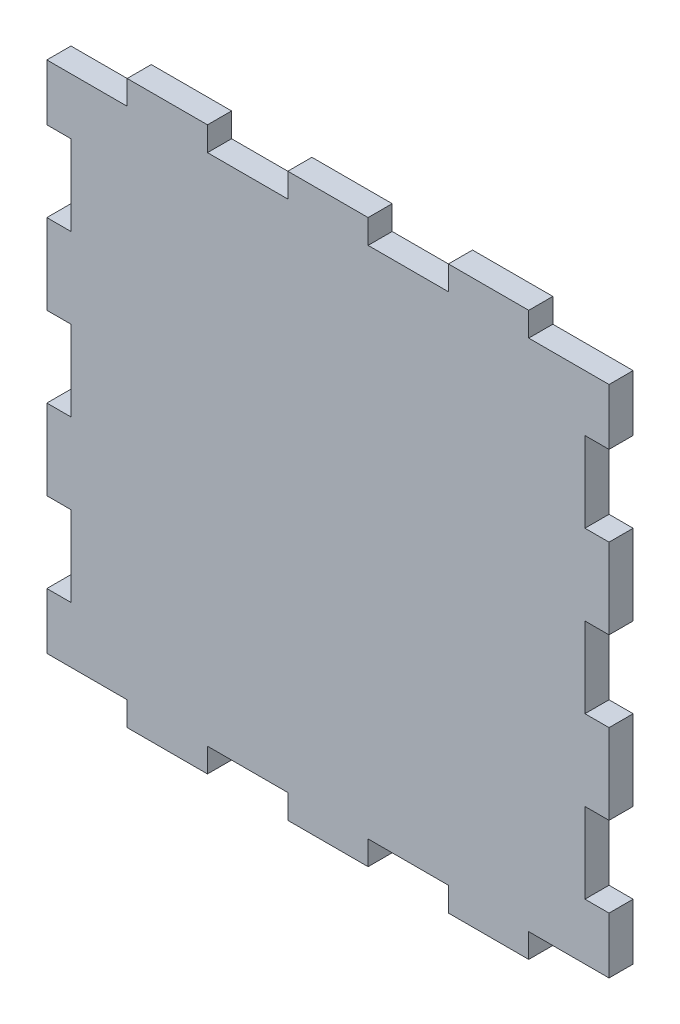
ISO-10303-21;
HEADER;
FILE_DESCRIPTION(('STEP AP214'),'2;1');
FILE_NAME('part.step','',(''),(''),'','','');
FILE_SCHEMA(('AUTOMOTIVE_DESIGN { 1 0 10303 214 1 1 1 1 }'));
ENDSEC;
DATA;
#1=APPLICATION_CONTEXT('core data for automotive mechanical design processes');
#2=APPLICATION_PROTOCOL_DEFINITION('international standard','automotive_design',2000,#1);
#3=PRODUCT_CONTEXT('',#1,'mechanical');
#4=PRODUCT('Part','Part','',(#3));
#5=PRODUCT_RELATED_PRODUCT_CATEGORY('part','',(#4));
#6=PRODUCT_DEFINITION_FORMATION('','',#4);
#7=PRODUCT_DEFINITION_CONTEXT('part definition',#1,'design');
#8=PRODUCT_DEFINITION('design','',#6,#7);
#9=PRODUCT_DEFINITION_SHAPE('','',#8);
#10=(LENGTH_UNIT() NAMED_UNIT(*) SI_UNIT(.MILLI.,.METRE.));
#11=(NAMED_UNIT(*) PLANE_ANGLE_UNIT() SI_UNIT($,.RADIAN.));
#12=(NAMED_UNIT(*) SI_UNIT($,.STERADIAN.) SOLID_ANGLE_UNIT());
#13=UNCERTAINTY_MEASURE_WITH_UNIT(LENGTH_MEASURE(1.E-05),#10,'distance_accuracy_value','');
#14=(GEOMETRIC_REPRESENTATION_CONTEXT(3) GLOBAL_UNCERTAINTY_ASSIGNED_CONTEXT((#13)) GLOBAL_UNIT_ASSIGNED_CONTEXT((#10,
#11,#12)) REPRESENTATION_CONTEXT('',''));
#15=CARTESIAN_POINT('',(0.,0.,0.));
#16=DIRECTION('',(0.,0.,1.));
#17=DIRECTION('',(1.,0.,0.));
#18=AXIS2_PLACEMENT_3D('',#15,#16,#17);
#19=CARTESIAN_POINT('',(-35.,35.,3.));
#20=DIRECTION('',(1.,0.,0.));
#21=DIRECTION('',(0.,1.,0.));
#22=AXIS2_PLACEMENT_3D('',#19,#20,#21);
#23=PLANE('',#22);
#24=DIRECTION('',(0.,-1.,0.));
#25=VECTOR('',#24,1.);
#26=CARTESIAN_POINT('',(-35.,35.,3.));
#27=LINE('',#26,#25);
#28=CARTESIAN_POINT('',(-35.,-5.,3.));
#29=VERTEX_POINT('',#28);
#30=CARTESIAN_POINT('',(-35.,-15.,3.));
#31=VERTEX_POINT('',#30);
#32=EDGE_CURVE('E391',#29,#31,#27,.T.);
#33=ORIENTED_EDGE('',*,*,#32,.F.);
#34=DIRECTION('',(0.,0.,-1.));
#35=VECTOR('',#34,1.);
#36=CARTESIAN_POINT('',(-35.,-5.,3.));
#37=LINE('',#36,#35);
#38=CARTESIAN_POINT('',(-35.,-5.,0.));
#39=VERTEX_POINT('',#38);
#40=EDGE_CURVE('E1084',#29,#39,#37,.T.);
#41=ORIENTED_EDGE('',*,*,#40,.T.);
#42=DIRECTION('',(0.,-1.,0.));
#43=VECTOR('',#42,1.);
#44=CARTESIAN_POINT('',(-35.,35.,0.));
#45=LINE('',#44,#43);
#46=CARTESIAN_POINT('',(-35.,-15.,0.));
#47=VERTEX_POINT('',#46);
#48=EDGE_CURVE('E1079',#39,#47,#45,.T.);
#49=ORIENTED_EDGE('',*,*,#48,.T.);
#50=DIRECTION('',(0.,0.,-1.));
#51=VECTOR('',#50,1.);
#52=CARTESIAN_POINT('',(-35.,-15.,3.));
#53=LINE('',#52,#51);
#54=EDGE_CURVE('E51',#31,#47,#53,.T.);
#55=ORIENTED_EDGE('',*,*,#54,.F.);
#56=EDGE_LOOP('',(#33,#41,#49,#55));
#57=FACE_BOUND('',#56,.T.);
#58=ADVANCED_FACE('F33',(#57),#23,.F.);
#59=CARTESIAN_POINT('',(-35.,-25.,3.));
#60=VERTEX_POINT('',#59);
#61=CARTESIAN_POINT('',(-35.,-32.,3.));
#62=VERTEX_POINT('',#61);
#63=EDGE_CURVE('E395',#60,#62,#27,.T.);
#64=ORIENTED_EDGE('',*,*,#63,.F.);
#65=DIRECTION('',(0.,0.,-1.));
#66=VECTOR('',#65,1.);
#67=CARTESIAN_POINT('',(-35.,-25.,3.));
#68=LINE('',#67,#66);
#69=CARTESIAN_POINT('',(-35.,-25.,0.));
#70=VERTEX_POINT('',#69);
#71=EDGE_CURVE('E1105',#60,#70,#68,.T.);
#72=ORIENTED_EDGE('',*,*,#71,.T.);
#73=CARTESIAN_POINT('',(-35.,-32.,0.));
#74=VERTEX_POINT('',#73);
#75=EDGE_CURVE('E414',#70,#74,#45,.T.);
#76=ORIENTED_EDGE('',*,*,#75,.T.);
#77=DIRECTION('',(0.,0.,-1.));
#78=VECTOR('',#77,1.);
#79=CARTESIAN_POINT('',(-35.,-32.,3.));
#80=LINE('',#79,#78);
#81=EDGE_CURVE('E519',#62,#74,#80,.T.);
#82=ORIENTED_EDGE('',*,*,#81,.F.);
#83=EDGE_LOOP('',(#64,#72,#76,#82));
#84=FACE_BOUND('',#83,.T.);
#85=ADVANCED_FACE('F769',(#84),#23,.F.);
#86=CARTESIAN_POINT('',(-35.,15.,0.));
#87=VERTEX_POINT('',#86);
#88=CARTESIAN_POINT('',(-35.,5.,0.));
#89=VERTEX_POINT('',#88);
#90=EDGE_CURVE('E382',#87,#89,#45,.T.);
#91=ORIENTED_EDGE('',*,*,#90,.T.);
#92=DIRECTION('',(0.,0.,-1.));
#93=VECTOR('',#92,1.);
#94=CARTESIAN_POINT('',(-35.,5.,3.));
#95=LINE('',#94,#93);
#96=CARTESIAN_POINT('',(-35.,5.,3.));
#97=VERTEX_POINT('',#96);
#98=EDGE_CURVE('E59',#97,#89,#95,.T.);
#99=ORIENTED_EDGE('',*,*,#98,.F.);
#100=CARTESIAN_POINT('',(-35.,15.,3.));
#101=VERTEX_POINT('',#100);
#102=EDGE_CURVE('E380',#101,#97,#27,.T.);
#103=ORIENTED_EDGE('',*,*,#102,.F.);
#104=DIRECTION('',(0.,0.,-1.));
#105=VECTOR('',#104,1.);
#106=CARTESIAN_POINT('',(-35.,15.,3.));
#107=LINE('',#106,#105);
#108=EDGE_CURVE('E685',#101,#87,#107,.T.);
#109=ORIENTED_EDGE('',*,*,#108,.T.);
#110=EDGE_LOOP('',(#91,#99,#103,#109));
#111=FACE_BOUND('',#110,.T.);
#112=ADVANCED_FACE('F378',(#111),#23,.F.);
#113=CARTESIAN_POINT('',(35.,35.,3.));
#114=DIRECTION('',(-1.,0.,0.));
#115=DIRECTION('',(0.,-1.,0.));
#116=AXIS2_PLACEMENT_3D('',#113,#114,#115);
#117=PLANE('',#116);
#118=DIRECTION('',(0.,1.,0.));
#119=VECTOR('',#118,1.);
#120=CARTESIAN_POINT('',(35.,35.,3.));
#121=LINE('',#120,#119);
#122=CARTESIAN_POINT('',(35.,5.,3.));
#123=VERTEX_POINT('',#122);
#124=CARTESIAN_POINT('',(35.,15.,3.));
#125=VERTEX_POINT('',#124);
#126=EDGE_CURVE('E407',#123,#125,#121,.T.);
#127=ORIENTED_EDGE('',*,*,#126,.F.);
#128=DIRECTION('',(0.,0.,-1.));
#129=VECTOR('',#128,1.);
#130=CARTESIAN_POINT('',(35.,5.,3.));
#131=LINE('',#130,#129);
#132=CARTESIAN_POINT('',(35.,5.,0.));
#133=VERTEX_POINT('',#132);
#134=EDGE_CURVE('E666',#123,#133,#131,.T.);
#135=ORIENTED_EDGE('',*,*,#134,.T.);
#136=DIRECTION('',(0.,1.,0.));
#137=VECTOR('',#136,1.);
#138=CARTESIAN_POINT('',(35.,35.,0.));
#139=LINE('',#138,#137);
#140=CARTESIAN_POINT('',(35.,15.,0.));
#141=VERTEX_POINT('',#140);
#142=EDGE_CURVE('E421',#133,#141,#139,.T.);
#143=ORIENTED_EDGE('',*,*,#142,.T.);
#144=DIRECTION('',(0.,0.,-1.));
#145=VECTOR('',#144,1.);
#146=CARTESIAN_POINT('',(35.,15.,3.));
#147=LINE('',#146,#145);
#148=EDGE_CURVE('E705',#125,#141,#147,.T.);
#149=ORIENTED_EDGE('',*,*,#148,.F.);
#150=EDGE_LOOP('',(#127,#135,#143,#149));
#151=FACE_BOUND('',#150,.T.);
#152=ADVANCED_FACE('F788',(#151),#117,.F.);
#153=CARTESIAN_POINT('',(35.,-15.,0.));
#154=VERTEX_POINT('',#153);
#155=CARTESIAN_POINT('',(35.,-4.99999999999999,0.));
#156=VERTEX_POINT('',#155);
#157=EDGE_CURVE('E420',#154,#156,#139,.T.);
#158=ORIENTED_EDGE('',*,*,#157,.T.);
#159=DIRECTION('',(0.,0.,-1.));
#160=VECTOR('',#159,1.);
#161=CARTESIAN_POINT('',(35.,-4.99999999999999,3.));
#162=LINE('',#161,#160);
#163=CARTESIAN_POINT('',(35.,-4.99999999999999,3.));
#164=VERTEX_POINT('',#163);
#165=EDGE_CURVE('E661',#164,#156,#162,.T.);
#166=ORIENTED_EDGE('',*,*,#165,.F.);
#167=CARTESIAN_POINT('',(35.,-15.,3.));
#168=VERTEX_POINT('',#167);
#169=EDGE_CURVE('E406',#168,#164,#121,.T.);
#170=ORIENTED_EDGE('',*,*,#169,.F.);
#171=DIRECTION('',(0.,0.,-1.));
#172=VECTOR('',#171,1.);
#173=CARTESIAN_POINT('',(35.,-15.,3.));
#174=LINE('',#173,#172);
#175=EDGE_CURVE('E659',#168,#154,#174,.T.);
#176=ORIENTED_EDGE('',*,*,#175,.T.);
#177=EDGE_LOOP('',(#158,#166,#170,#176));
#178=FACE_BOUND('',#177,.T.);
#179=ADVANCED_FACE('F658',(#178),#117,.F.);
#180=CARTESIAN_POINT('',(35.,25.,3.));
#181=VERTEX_POINT('',#180);
#182=CARTESIAN_POINT('',(35.,32.,3.));
#183=VERTEX_POINT('',#182);
#184=EDGE_CURVE('E408',#181,#183,#121,.T.);
#185=ORIENTED_EDGE('',*,*,#184,.F.);
#186=DIRECTION('',(0.,0.,-1.));
#187=VECTOR('',#186,1.);
#188=CARTESIAN_POINT('',(35.,25.,3.));
#189=LINE('',#188,#187);
#190=CARTESIAN_POINT('',(35.,25.,0.));
#191=VERTEX_POINT('',#190);
#192=EDGE_CURVE('E515',#181,#191,#189,.T.);
#193=ORIENTED_EDGE('',*,*,#192,.T.);
#194=CARTESIAN_POINT('',(35.,32.,0.));
#195=VERTEX_POINT('',#194);
#196=EDGE_CURVE('E422',#191,#195,#139,.T.);
#197=ORIENTED_EDGE('',*,*,#196,.T.);
#198=DIRECTION('',(0.,0.,-1.));
#199=VECTOR('',#198,1.);
#200=CARTESIAN_POINT('',(35.,32.,3.));
#201=LINE('',#200,#199);
#202=EDGE_CURVE('E399',#183,#195,#201,.T.);
#203=ORIENTED_EDGE('',*,*,#202,.F.);
#204=EDGE_LOOP('',(#185,#193,#197,#203));
#205=FACE_BOUND('',#204,.T.);
#206=ADVANCED_FACE('F797',(#205),#117,.F.);
#207=CARTESIAN_POINT('',(35.,-35.,3.));
#208=DIRECTION('',(0.,1.,0.));
#209=DIRECTION('',(-1.,0.,0.));
#210=AXIS2_PLACEMENT_3D('',#207,#208,#209);
#211=PLANE('',#210);
#212=DIRECTION('',(1.,0.,0.));
#213=VECTOR('',#212,1.);
#214=CARTESIAN_POINT('',(35.,-35.,3.));
#215=LINE('',#214,#213);
#216=CARTESIAN_POINT('',(15.,-35.,3.));
#217=VERTEX_POINT('',#216);
#218=CARTESIAN_POINT('',(25.,-35.,3.));
#219=VERTEX_POINT('',#218);
#220=EDGE_CURVE('E394',#217,#219,#215,.T.);
#221=ORIENTED_EDGE('',*,*,#220,.F.);
#222=DIRECTION('',(0.,0.,-1.));
#223=VECTOR('',#222,1.);
#224=CARTESIAN_POINT('',(15.,-35.,3.));
#225=LINE('',#224,#223);
#226=CARTESIAN_POINT('',(15.,-35.,0.));
#227=VERTEX_POINT('',#226);
#228=EDGE_CURVE('E478',#217,#227,#225,.T.);
#229=ORIENTED_EDGE('',*,*,#228,.T.);
#230=DIRECTION('',(1.,0.,0.));
#231=VECTOR('',#230,1.);
#232=CARTESIAN_POINT('',(35.,-35.,0.));
#233=LINE('',#232,#231);
#234=CARTESIAN_POINT('',(25.,-35.,0.));
#235=VERTEX_POINT('',#234);
#236=EDGE_CURVE('E413',#227,#235,#233,.T.);
#237=ORIENTED_EDGE('',*,*,#236,.T.);
#238=DIRECTION('',(0.,0.,-1.));
#239=VECTOR('',#238,1.);
#240=CARTESIAN_POINT('',(25.,-35.,3.));
#241=LINE('',#240,#239);
#242=EDGE_CURVE('E530',#219,#235,#241,.T.);
#243=ORIENTED_EDGE('',*,*,#242,.F.);
#244=EDGE_LOOP('',(#221,#229,#237,#243));
#245=FACE_BOUND('',#244,.T.);
#246=ADVANCED_FACE('F734',(#245),#211,.F.);
#247=CARTESIAN_POINT('',(-5.,-35.,0.));
#248=VERTEX_POINT('',#247);
#249=CARTESIAN_POINT('',(5.,-35.,0.));
#250=VERTEX_POINT('',#249);
#251=EDGE_CURVE('E415',#248,#250,#233,.T.);
#252=ORIENTED_EDGE('',*,*,#251,.T.);
#253=DIRECTION('',(0.,0.,-1.));
#254=VECTOR('',#253,1.);
#255=CARTESIAN_POINT('',(5.,-35.,3.));
#256=LINE('',#255,#254);
#257=CARTESIAN_POINT('',(5.,-35.,3.));
#258=VERTEX_POINT('',#257);
#259=EDGE_CURVE('E447',#258,#250,#256,.T.);
#260=ORIENTED_EDGE('',*,*,#259,.F.);
#261=CARTESIAN_POINT('',(-5.,-35.,3.));
#262=VERTEX_POINT('',#261);
#263=EDGE_CURVE('E402',#262,#258,#215,.T.);
#264=ORIENTED_EDGE('',*,*,#263,.F.);
#265=DIRECTION('',(0.,0.,-1.));
#266=VECTOR('',#265,1.);
#267=CARTESIAN_POINT('',(-5.,-35.,3.));
#268=LINE('',#267,#266);
#269=EDGE_CURVE('E449',#262,#248,#268,.T.);
#270=ORIENTED_EDGE('',*,*,#269,.T.);
#271=EDGE_LOOP('',(#252,#260,#264,#270));
#272=FACE_BOUND('',#271,.T.);
#273=ADVANCED_FACE('F445',(#272),#211,.F.);
#274=CARTESIAN_POINT('',(35.,35.,3.));
#275=DIRECTION('',(0.,-1.,0.));
#276=DIRECTION('',(1.,0.,0.));
#277=AXIS2_PLACEMENT_3D('',#274,#275,#276);
#278=PLANE('',#277);
#279=DIRECTION('',(-1.,0.,0.));
#280=VECTOR('',#279,1.);
#281=CARTESIAN_POINT('',(35.,35.,0.));
#282=LINE('',#281,#280);
#283=CARTESIAN_POINT('',(25.,35.,0.));
#284=VERTEX_POINT('',#283);
#285=CARTESIAN_POINT('',(15.,35.,0.));
#286=VERTEX_POINT('',#285);
#287=EDGE_CURVE('E37',#284,#286,#282,.T.);
#288=ORIENTED_EDGE('',*,*,#287,.T.);
#289=DIRECTION('',(0.,0.,-1.));
#290=VECTOR('',#289,1.);
#291=CARTESIAN_POINT('',(15.,35.,3.));
#292=LINE('',#291,#290);
#293=CARTESIAN_POINT('',(15.,35.,3.));
#294=VERTEX_POINT('',#293);
#295=EDGE_CURVE('E559',#294,#286,#292,.T.);
#296=ORIENTED_EDGE('',*,*,#295,.F.);
#297=DIRECTION('',(-1.,0.,0.));
#298=VECTOR('',#297,1.);
#299=CARTESIAN_POINT('',(35.,35.,3.));
#300=LINE('',#299,#298);
#301=CARTESIAN_POINT('',(25.,35.,3.));
#302=VERTEX_POINT('',#301);
#303=EDGE_CURVE('E11',#302,#294,#300,.T.);
#304=ORIENTED_EDGE('',*,*,#303,.F.);
#305=DIRECTION('',(0.,0.,-1.));
#306=VECTOR('',#305,1.);
#307=CARTESIAN_POINT('',(25.,35.,3.));
#308=LINE('',#307,#306);
#309=EDGE_CURVE('E621',#302,#284,#308,.T.);
#310=ORIENTED_EDGE('',*,*,#309,.T.);
#311=EDGE_LOOP('',(#288,#296,#304,#310));
#312=FACE_BOUND('',#311,.T.);
#313=ADVANCED_FACE('F639',(#312),#278,.F.);
#314=CARTESIAN_POINT('',(4.99999999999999,35.,3.));
#315=VERTEX_POINT('',#314);
#316=CARTESIAN_POINT('',(-5.00000000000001,35.,3.));
#317=VERTEX_POINT('',#316);
#318=EDGE_CURVE('E42',#315,#317,#300,.T.);
#319=ORIENTED_EDGE('',*,*,#318,.F.);
#320=DIRECTION('',(0.,0.,-1.));
#321=VECTOR('',#320,1.);
#322=CARTESIAN_POINT('',(4.99999999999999,35.,3.));
#323=LINE('',#322,#321);
#324=CARTESIAN_POINT('',(4.99999999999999,35.,0.));
#325=VERTEX_POINT('',#324);
#326=EDGE_CURVE('E562',#315,#325,#323,.T.);
#327=ORIENTED_EDGE('',*,*,#326,.T.);
#328=CARTESIAN_POINT('',(-5.00000000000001,35.,0.));
#329=VERTEX_POINT('',#328);
#330=EDGE_CURVE('E428',#325,#329,#282,.T.);
#331=ORIENTED_EDGE('',*,*,#330,.T.);
#332=DIRECTION('',(0.,0.,-1.));
#333=VECTOR('',#332,1.);
#334=CARTESIAN_POINT('',(-5.00000000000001,35.,3.));
#335=LINE('',#334,#333);
#336=EDGE_CURVE('E555',#317,#329,#335,.T.);
#337=ORIENTED_EDGE('',*,*,#336,.F.);
#338=EDGE_LOOP('',(#319,#327,#331,#337));
#339=FACE_BOUND('',#338,.T.);
#340=ADVANCED_FACE('F778',(#339),#278,.F.);
#341=CARTESIAN_POINT('',(-35.,32.,0.));
#342=VERTEX_POINT('',#341);
#343=CARTESIAN_POINT('',(-35.,25.,0.));
#344=VERTEX_POINT('',#343);
#345=EDGE_CURVE('E410',#342,#344,#45,.T.);
#346=ORIENTED_EDGE('',*,*,#345,.T.);
#347=DIRECTION('',(0.,0.,-1.));
#348=VECTOR('',#347,1.);
#349=CARTESIAN_POINT('',(-35.,25.,3.));
#350=LINE('',#349,#348);
#351=CARTESIAN_POINT('',(-35.,25.,3.));
#352=VERTEX_POINT('',#351);
#353=EDGE_CURVE('E1120',#352,#344,#350,.T.);
#354=ORIENTED_EDGE('',*,*,#353,.F.);
#355=CARTESIAN_POINT('',(-35.,32.,3.));
#356=VERTEX_POINT('',#355);
#357=EDGE_CURVE('E390',#356,#352,#27,.T.);
#358=ORIENTED_EDGE('',*,*,#357,.F.);
#359=DIRECTION('',(0.,0.,-1.));
#360=VECTOR('',#359,1.);
#361=CARTESIAN_POINT('',(-35.,32.,3.));
#362=LINE('',#361,#360);
#363=EDGE_CURVE('E606',#356,#342,#362,.T.);
#364=ORIENTED_EDGE('',*,*,#363,.T.);
#365=EDGE_LOOP('',(#346,#354,#358,#364));
#366=FACE_BOUND('',#365,.T.);
#367=ADVANCED_FACE('F35',(#366),#23,.F.);
#368=CARTESIAN_POINT('',(-25.,-35.,0.));
#369=VERTEX_POINT('',#368);
#370=CARTESIAN_POINT('',(-15.,-35.,0.));
#371=VERTEX_POINT('',#370);
#372=EDGE_CURVE('E416',#369,#371,#233,.T.);
#373=ORIENTED_EDGE('',*,*,#372,.T.);
#374=DIRECTION('',(0.,0.,-1.));
#375=VECTOR('',#374,1.);
#376=CARTESIAN_POINT('',(-15.,-35.,3.));
#377=LINE('',#376,#375);
#378=CARTESIAN_POINT('',(-15.,-35.,3.));
#379=VERTEX_POINT('',#378);
#380=EDGE_CURVE('E502',#379,#371,#377,.T.);
#381=ORIENTED_EDGE('',*,*,#380,.F.);
#382=CARTESIAN_POINT('',(-25.,-35.,3.));
#383=VERTEX_POINT('',#382);
#384=EDGE_CURVE('E403',#383,#379,#215,.T.);
#385=ORIENTED_EDGE('',*,*,#384,.F.);
#386=DIRECTION('',(0.,0.,-1.));
#387=VECTOR('',#386,1.);
#388=CARTESIAN_POINT('',(-25.,-35.,3.));
#389=LINE('',#388,#387);
#390=EDGE_CURVE('E512',#383,#369,#389,.T.);
#391=ORIENTED_EDGE('',*,*,#390,.T.);
#392=EDGE_LOOP('',(#373,#381,#385,#391));
#393=FACE_BOUND('',#392,.T.);
#394=ADVANCED_FACE('F777',(#393),#211,.F.);
#395=CARTESIAN_POINT('',(35.,-32.,0.));
#396=VERTEX_POINT('',#395);
#397=CARTESIAN_POINT('',(35.,-25.,0.));
#398=VERTEX_POINT('',#397);
#399=EDGE_CURVE('E417',#396,#398,#139,.T.);
#400=ORIENTED_EDGE('',*,*,#399,.T.);
#401=DIRECTION('',(0.,0.,-1.));
#402=VECTOR('',#401,1.);
#403=CARTESIAN_POINT('',(35.,-25.,3.));
#404=LINE('',#403,#402);
#405=CARTESIAN_POINT('',(35.,-25.,3.));
#406=VERTEX_POINT('',#405);
#407=EDGE_CURVE('E695',#406,#398,#404,.T.);
#408=ORIENTED_EDGE('',*,*,#407,.F.);
#409=CARTESIAN_POINT('',(35.,-32.,3.));
#410=VERTEX_POINT('',#409);
#411=EDGE_CURVE('E404',#410,#406,#121,.T.);
#412=ORIENTED_EDGE('',*,*,#411,.F.);
#413=DIRECTION('',(0.,0.,-1.));
#414=VECTOR('',#413,1.);
#415=CARTESIAN_POINT('',(35.,-32.,3.));
#416=LINE('',#415,#414);
#417=EDGE_CURVE('E534',#410,#396,#416,.T.);
#418=ORIENTED_EDGE('',*,*,#417,.T.);
#419=EDGE_LOOP('',(#400,#408,#412,#418));
#420=FACE_BOUND('',#419,.T.);
#421=ADVANCED_FACE('F744',(#420),#117,.F.);
#422=CARTESIAN_POINT('',(-15.,35.,3.));
#423=VERTEX_POINT('',#422);
#424=CARTESIAN_POINT('',(-25.,35.,3.));
#425=VERTEX_POINT('',#424);
#426=EDGE_CURVE('E44',#423,#425,#300,.T.);
#427=ORIENTED_EDGE('',*,*,#426,.F.);
#428=DIRECTION('',(0.,0.,-1.));
#429=VECTOR('',#428,1.);
#430=CARTESIAN_POINT('',(-15.,35.,3.));
#431=LINE('',#430,#429);
#432=CARTESIAN_POINT('',(-15.,35.,0.));
#433=VERTEX_POINT('',#432);
#434=EDGE_CURVE('E588',#423,#433,#431,.T.);
#435=ORIENTED_EDGE('',*,*,#434,.T.);
#436=CARTESIAN_POINT('',(-25.,35.,0.));
#437=VERTEX_POINT('',#436);
#438=EDGE_CURVE('E419',#433,#437,#282,.T.);
#439=ORIENTED_EDGE('',*,*,#438,.T.);
#440=DIRECTION('',(0.,0.,-1.));
#441=VECTOR('',#440,1.);
#442=CARTESIAN_POINT('',(-25.,35.,3.));
#443=LINE('',#442,#441);
#444=EDGE_CURVE('E583',#425,#437,#443,.T.);
#445=ORIENTED_EDGE('',*,*,#444,.F.);
#446=EDGE_LOOP('',(#427,#435,#439,#445));
#447=FACE_BOUND('',#446,.T.);
#448=ADVANCED_FACE('F786',(#447),#278,.F.);
#449=CARTESIAN_POINT('',(0.,0.,3.));
#450=DIRECTION('',(0.,0.,-1.));
#451=DIRECTION('',(-1.,0.,0.));
#452=AXIS2_PLACEMENT_3D('',#449,#450,#451);
#453=PLANE('',#452);
#454=DIRECTION('',(0.,-1.,0.));
#455=VECTOR('',#454,1.);
#456=CARTESIAN_POINT('',(-32.,5.,3.));
#457=LINE('',#456,#455);
#458=CARTESIAN_POINT('',(-32.,5.,3.));
#459=VERTEX_POINT('',#458);
#460=CARTESIAN_POINT('',(-32.,-5.,3.));
#461=VERTEX_POINT('',#460);
#462=EDGE_CURVE('E372',#459,#461,#457,.T.);
#463=ORIENTED_EDGE('',*,*,#462,.T.);
#464=DIRECTION('',(-1.,0.,0.));
#465=VECTOR('',#464,1.);
#466=CARTESIAN_POINT('',(-35.,-5.,3.));
#467=LINE('',#466,#465);
#468=EDGE_CURVE('E383',#461,#29,#467,.T.);
#469=ORIENTED_EDGE('',*,*,#468,.T.);
#470=ORIENTED_EDGE('',*,*,#32,.T.);
#471=DIRECTION('',(1.,0.,0.));
#472=VECTOR('',#471,1.);
#473=CARTESIAN_POINT('',(-35.,-15.,3.));
#474=LINE('',#473,#472);
#475=CARTESIAN_POINT('',(-32.,-15.,3.));
#476=VERTEX_POINT('',#475);
#477=EDGE_CURVE('E1089',#31,#476,#474,.T.);
#478=ORIENTED_EDGE('',*,*,#477,.T.);
#479=DIRECTION('',(0.,-1.,0.));
#480=VECTOR('',#479,1.);
#481=CARTESIAN_POINT('',(-32.,-15.,3.));
#482=LINE('',#481,#480);
#483=CARTESIAN_POINT('',(-32.,-25.,3.));
#484=VERTEX_POINT('',#483);
#485=EDGE_CURVE('E1092',#476,#484,#482,.T.);
#486=ORIENTED_EDGE('',*,*,#485,.T.);
#487=DIRECTION('',(-1.,0.,0.));
#488=VECTOR('',#487,1.);
#489=CARTESIAN_POINT('',(-35.,-25.,3.));
#490=LINE('',#489,#488);
#491=EDGE_CURVE('E1096',#484,#60,#490,.T.);
#492=ORIENTED_EDGE('',*,*,#491,.T.);
#493=ORIENTED_EDGE('',*,*,#63,.T.);
#494=DIRECTION('',(1.,0.,0.));
#495=VECTOR('',#494,1.);
#496=CARTESIAN_POINT('',(-25.,-32.,3.));
#497=LINE('',#496,#495);
#498=CARTESIAN_POINT('',(-25.,-32.,3.));
#499=VERTEX_POINT('',#498);
#500=EDGE_CURVE('E508',#62,#499,#497,.T.);
#501=ORIENTED_EDGE('',*,*,#500,.T.);
#502=DIRECTION('',(0.,-1.,0.));
#503=VECTOR('',#502,1.);
#504=CARTESIAN_POINT('',(-25.,-35.,3.));
#505=LINE('',#504,#503);
#506=EDGE_CURVE('E505',#499,#383,#505,.T.);
#507=ORIENTED_EDGE('',*,*,#506,.T.);
#508=ORIENTED_EDGE('',*,*,#384,.T.);
#509=DIRECTION('',(0.,1.,0.));
#510=VECTOR('',#509,1.);
#511=CARTESIAN_POINT('',(-15.,-35.,3.));
#512=LINE('',#511,#510);
#513=CARTESIAN_POINT('',(-15.,-32.,3.));
#514=VERTEX_POINT('',#513);
#515=EDGE_CURVE('E485',#379,#514,#512,.T.);
#516=ORIENTED_EDGE('',*,*,#515,.T.);
#517=DIRECTION('',(1.,0.,0.));
#518=VECTOR('',#517,1.);
#519=CARTESIAN_POINT('',(-5.,-32.,3.));
#520=LINE('',#519,#518);
#521=CARTESIAN_POINT('',(-5.,-32.,3.));
#522=VERTEX_POINT('',#521);
#523=EDGE_CURVE('E489',#514,#522,#520,.T.);
#524=ORIENTED_EDGE('',*,*,#523,.T.);
#525=DIRECTION('',(0.,-1.,0.));
#526=VECTOR('',#525,1.);
#527=CARTESIAN_POINT('',(-5.,-35.,3.));
#528=LINE('',#527,#526);
#529=EDGE_CURVE('E482',#522,#262,#528,.T.);
#530=ORIENTED_EDGE('',*,*,#529,.T.);
#531=ORIENTED_EDGE('',*,*,#263,.T.);
#532=DIRECTION('',(0.,1.,0.));
#533=VECTOR('',#532,1.);
#534=CARTESIAN_POINT('',(5.,-35.,3.));
#535=LINE('',#534,#533);
#536=CARTESIAN_POINT('',(5.,-32.,3.));
#537=VERTEX_POINT('',#536);
#538=EDGE_CURVE('E722',#258,#537,#535,.T.);
#539=ORIENTED_EDGE('',*,*,#538,.T.);
#540=DIRECTION('',(1.,0.,0.));
#541=VECTOR('',#540,1.);
#542=CARTESIAN_POINT('',(15.,-32.,3.));
#543=LINE('',#542,#541);
#544=CARTESIAN_POINT('',(15.,-32.,3.));
#545=VERTEX_POINT('',#544);
#546=EDGE_CURVE('E481',#537,#545,#543,.T.);
#547=ORIENTED_EDGE('',*,*,#546,.T.);
#548=DIRECTION('',(0.,-1.,0.));
#549=VECTOR('',#548,1.);
#550=CARTESIAN_POINT('',(15.,-35.,3.));
#551=LINE('',#550,#549);
#552=EDGE_CURVE('E466',#545,#217,#551,.T.);
#553=ORIENTED_EDGE('',*,*,#552,.T.);
#554=ORIENTED_EDGE('',*,*,#220,.T.);
#555=DIRECTION('',(0.,1.,0.));
#556=VECTOR('',#555,1.);
#557=CARTESIAN_POINT('',(25.,-35.,3.));
#558=LINE('',#557,#556);
#559=CARTESIAN_POINT('',(25.,-32.,3.));
#560=VERTEX_POINT('',#559);
#561=EDGE_CURVE('E523',#219,#560,#558,.T.);
#562=ORIENTED_EDGE('',*,*,#561,.T.);
#563=DIRECTION('',(1.,0.,0.));
#564=VECTOR('',#563,1.);
#565=CARTESIAN_POINT('',(35.,-32.,3.));
#566=LINE('',#565,#564);
#567=EDGE_CURVE('E526',#560,#410,#566,.T.);
#568=ORIENTED_EDGE('',*,*,#567,.T.);
#569=ORIENTED_EDGE('',*,*,#411,.T.);
#570=DIRECTION('',(-1.,0.,0.));
#571=VECTOR('',#570,1.);
#572=CARTESIAN_POINT('',(35.,-25.,3.));
#573=LINE('',#572,#571);
#574=CARTESIAN_POINT('',(32.,-25.,3.));
#575=VERTEX_POINT('',#574);
#576=EDGE_CURVE('E676',#406,#575,#573,.T.);
#577=ORIENTED_EDGE('',*,*,#576,.T.);
#578=DIRECTION('',(0.,1.,0.));
#579=VECTOR('',#578,1.);
#580=CARTESIAN_POINT('',(32.,-15.,3.));
#581=LINE('',#580,#579);
#582=CARTESIAN_POINT('',(32.,-15.,3.));
#583=VERTEX_POINT('',#582);
#584=EDGE_CURVE('E680',#575,#583,#581,.T.);
#585=ORIENTED_EDGE('',*,*,#584,.T.);
#586=DIRECTION('',(1.,0.,0.));
#587=VECTOR('',#586,1.);
#588=CARTESIAN_POINT('',(35.,-15.,3.));
#589=LINE('',#588,#587);
#590=EDGE_CURVE('E654',#583,#168,#589,.T.);
#591=ORIENTED_EDGE('',*,*,#590,.T.);
#592=ORIENTED_EDGE('',*,*,#169,.T.);
#593=DIRECTION('',(-1.,0.,0.));
#594=VECTOR('',#593,1.);
#595=CARTESIAN_POINT('',(35.,-4.99999999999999,3.));
#596=LINE('',#595,#594);
#597=CARTESIAN_POINT('',(32.,-4.99999999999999,3.));
#598=VERTEX_POINT('',#597);
#599=EDGE_CURVE('E651',#164,#598,#596,.T.);
#600=ORIENTED_EDGE('',*,*,#599,.T.);
#601=DIRECTION('',(0.,1.,0.));
#602=VECTOR('',#601,1.);
#603=CARTESIAN_POINT('',(32.,5.,3.));
#604=LINE('',#603,#602);
#605=CARTESIAN_POINT('',(32.,5.,3.));
#606=VERTEX_POINT('',#605);
#607=EDGE_CURVE('E671',#598,#606,#604,.T.);
#608=ORIENTED_EDGE('',*,*,#607,.T.);
#609=DIRECTION('',(1.,0.,0.));
#610=VECTOR('',#609,1.);
#611=CARTESIAN_POINT('',(35.,5.,3.));
#612=LINE('',#611,#610);
#613=EDGE_CURVE('E913',#606,#123,#612,.T.);
#614=ORIENTED_EDGE('',*,*,#613,.T.);
#615=ORIENTED_EDGE('',*,*,#126,.T.);
#616=DIRECTION('',(-1.,0.,0.));
#617=VECTOR('',#616,1.);
#618=CARTESIAN_POINT('',(35.,15.,3.));
#619=LINE('',#618,#617);
#620=CARTESIAN_POINT('',(32.,15.,3.));
#621=VERTEX_POINT('',#620);
#622=EDGE_CURVE('E698',#125,#621,#619,.T.);
#623=ORIENTED_EDGE('',*,*,#622,.T.);
#624=DIRECTION('',(0.,1.,0.));
#625=VECTOR('',#624,1.);
#626=CARTESIAN_POINT('',(32.,25.,3.));
#627=LINE('',#626,#625);
#628=CARTESIAN_POINT('',(32.,25.,3.));
#629=VERTEX_POINT('',#628);
#630=EDGE_CURVE('E701',#621,#629,#627,.T.);
#631=ORIENTED_EDGE('',*,*,#630,.T.);
#632=DIRECTION('',(1.,0.,0.));
#633=VECTOR('',#632,1.);
#634=CARTESIAN_POINT('',(35.,25.,3.));
#635=LINE('',#634,#633);
#636=EDGE_CURVE('E644',#629,#181,#635,.T.);
#637=ORIENTED_EDGE('',*,*,#636,.T.);
#638=ORIENTED_EDGE('',*,*,#184,.T.);
#639=DIRECTION('',(-1.,0.,0.));
#640=VECTOR('',#639,1.);
#641=CARTESIAN_POINT('',(35.,32.,3.));
#642=LINE('',#641,#640);
#643=CARTESIAN_POINT('',(25.,32.,3.));
#644=VERTEX_POINT('',#643);
#645=EDGE_CURVE('E611',#183,#644,#642,.T.);
#646=ORIENTED_EDGE('',*,*,#645,.T.);
#647=DIRECTION('',(0.,1.,0.));
#648=VECTOR('',#647,1.);
#649=CARTESIAN_POINT('',(25.,35.,3.));
#650=LINE('',#649,#648);
#651=EDGE_CURVE('E614',#644,#302,#650,.T.);
#652=ORIENTED_EDGE('',*,*,#651,.T.);
#653=ORIENTED_EDGE('',*,*,#303,.T.);
#654=DIRECTION('',(0.,-1.,0.));
#655=VECTOR('',#654,1.);
#656=CARTESIAN_POINT('',(15.,35.,3.));
#657=LINE('',#656,#655);
#658=CARTESIAN_POINT('',(15.,32.,3.));
#659=VERTEX_POINT('',#658);
#660=EDGE_CURVE('E541',#294,#659,#657,.T.);
#661=ORIENTED_EDGE('',*,*,#660,.T.);
#662=DIRECTION('',(-1.,0.,0.));
#663=VECTOR('',#662,1.);
#664=CARTESIAN_POINT('',(15.,32.,3.));
#665=LINE('',#664,#663);
#666=CARTESIAN_POINT('',(4.99999999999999,32.,3.));
#667=VERTEX_POINT('',#666);
#668=EDGE_CURVE('E544',#659,#667,#665,.T.);
#669=ORIENTED_EDGE('',*,*,#668,.T.);
#670=DIRECTION('',(0.,1.,0.));
#671=VECTOR('',#670,1.);
#672=CARTESIAN_POINT('',(4.99999999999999,35.,3.));
#673=LINE('',#672,#671);
#674=EDGE_CURVE('E548',#667,#315,#673,.T.);
#675=ORIENTED_EDGE('',*,*,#674,.T.);
#676=ORIENTED_EDGE('',*,*,#318,.T.);
#677=DIRECTION('',(0.,-1.,0.));
#678=VECTOR('',#677,1.);
#679=CARTESIAN_POINT('',(-5.00000000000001,35.,3.));
#680=LINE('',#679,#678);
#681=CARTESIAN_POINT('',(-5.00000000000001,32.,3.));
#682=VERTEX_POINT('',#681);
#683=EDGE_CURVE('E569',#317,#682,#680,.T.);
#684=ORIENTED_EDGE('',*,*,#683,.T.);
#685=DIRECTION('',(-1.,0.,0.));
#686=VECTOR('',#685,1.);
#687=CARTESIAN_POINT('',(-5.00000000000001,32.,3.));
#688=LINE('',#687,#686);
#689=CARTESIAN_POINT('',(-15.,32.,3.));
#690=VERTEX_POINT('',#689);
#691=EDGE_CURVE('E572',#682,#690,#688,.T.);
#692=ORIENTED_EDGE('',*,*,#691,.T.);
#693=DIRECTION('',(0.,1.,0.));
#694=VECTOR('',#693,1.);
#695=CARTESIAN_POINT('',(-15.,35.,3.));
#696=LINE('',#695,#694);
#697=EDGE_CURVE('E576',#690,#423,#696,.T.);
#698=ORIENTED_EDGE('',*,*,#697,.T.);
#699=ORIENTED_EDGE('',*,*,#426,.T.);
#700=DIRECTION('',(0.,-1.,0.));
#701=VECTOR('',#700,1.);
#702=CARTESIAN_POINT('',(-25.,35.,3.));
#703=LINE('',#702,#701);
#704=CARTESIAN_POINT('',(-25.,32.,3.));
#705=VERTEX_POINT('',#704);
#706=EDGE_CURVE('E595',#425,#705,#703,.T.);
#707=ORIENTED_EDGE('',*,*,#706,.T.);
#708=DIRECTION('',(-1.,0.,0.));
#709=VECTOR('',#708,1.);
#710=CARTESIAN_POINT('',(-25.,32.,3.));
#711=LINE('',#710,#709);
#712=EDGE_CURVE('E598',#705,#356,#711,.T.);
#713=ORIENTED_EDGE('',*,*,#712,.T.);
#714=ORIENTED_EDGE('',*,*,#357,.T.);
#715=DIRECTION('',(1.,0.,0.));
#716=VECTOR('',#715,1.);
#717=CARTESIAN_POINT('',(-35.,25.,3.));
#718=LINE('',#717,#716);
#719=CARTESIAN_POINT('',(-32.,25.,3.));
#720=VERTEX_POINT('',#719);
#721=EDGE_CURVE('E1113',#352,#720,#718,.T.);
#722=ORIENTED_EDGE('',*,*,#721,.T.);
#723=DIRECTION('',(0.,-1.,0.));
#724=VECTOR('',#723,1.);
#725=CARTESIAN_POINT('',(-32.,25.,3.));
#726=LINE('',#725,#724);
#727=CARTESIAN_POINT('',(-32.,15.,3.));
#728=VERTEX_POINT('',#727);
#729=EDGE_CURVE('E1116',#720,#728,#726,.T.);
#730=ORIENTED_EDGE('',*,*,#729,.T.);
#731=DIRECTION('',(-1.,0.,0.));
#732=VECTOR('',#731,1.);
#733=CARTESIAN_POINT('',(-35.,15.,3.));
#734=LINE('',#733,#732);
#735=EDGE_CURVE('E389',#728,#101,#734,.T.);
#736=ORIENTED_EDGE('',*,*,#735,.T.);
#737=ORIENTED_EDGE('',*,*,#102,.T.);
#738=DIRECTION('',(1.,0.,0.));
#739=VECTOR('',#738,1.);
#740=CARTESIAN_POINT('',(-35.,5.,3.));
#741=LINE('',#740,#739);
#742=EDGE_CURVE('E365',#97,#459,#741,.T.);
#743=ORIENTED_EDGE('',*,*,#742,.T.);
#744=EDGE_LOOP('',(#463,#469,#470,#478,#486,#492,#493,#501,#507,#508,#516,#524,#530,#531,#539,
#547,#553,#554,#562,#568,#569,#577,#585,#591,#592,#600,#608,#614,#615,#623,#631,#637,#638,#646,
#652,#653,#661,#669,#675,#676,#684,#692,#698,#699,#707,#713,#714,#722,#730,#736,#737,#743));
#745=FACE_BOUND('',#744,.T.);
#746=ADVANCED_FACE('F386',(#745),#453,.F.);
#747=CARTESIAN_POINT('',(0.,0.,0.));
#748=DIRECTION('',(0.,0.,-1.));
#749=DIRECTION('',(-1.,0.,0.));
#750=AXIS2_PLACEMENT_3D('',#747,#748,#749);
#751=PLANE('',#750);
#752=DIRECTION('',(-1.,0.,0.));
#753=VECTOR('',#752,1.);
#754=CARTESIAN_POINT('',(-35.,-5.,0.));
#755=LINE('',#754,#753);
#756=CARTESIAN_POINT('',(-32.,-5.,0.));
#757=VERTEX_POINT('',#756);
#758=EDGE_CURVE('E373',#757,#39,#755,.T.);
#759=ORIENTED_EDGE('',*,*,#758,.F.);
#760=DIRECTION('',(0.,-1.,0.));
#761=VECTOR('',#760,1.);
#762=CARTESIAN_POINT('',(-32.,5.,0.));
#763=LINE('',#762,#761);
#764=CARTESIAN_POINT('',(-32.,5.,0.));
#765=VERTEX_POINT('',#764);
#766=EDGE_CURVE('E1072',#765,#757,#763,.T.);
#767=ORIENTED_EDGE('',*,*,#766,.F.);
#768=DIRECTION('',(1.,0.,0.));
#769=VECTOR('',#768,1.);
#770=CARTESIAN_POINT('',(-35.,5.,0.));
#771=LINE('',#770,#769);
#772=EDGE_CURVE('E1075',#89,#765,#771,.T.);
#773=ORIENTED_EDGE('',*,*,#772,.F.);
#774=ORIENTED_EDGE('',*,*,#90,.F.);
#775=DIRECTION('',(-1.,0.,0.));
#776=VECTOR('',#775,1.);
#777=CARTESIAN_POINT('',(-35.,15.,0.));
#778=LINE('',#777,#776);
#779=CARTESIAN_POINT('',(-32.,15.,0.));
#780=VERTEX_POINT('',#779);
#781=EDGE_CURVE('E1117',#780,#87,#778,.T.);
#782=ORIENTED_EDGE('',*,*,#781,.F.);
#783=DIRECTION('',(0.,-1.,0.));
#784=VECTOR('',#783,1.);
#785=CARTESIAN_POINT('',(-32.,25.,0.));
#786=LINE('',#785,#784);
#787=CARTESIAN_POINT('',(-32.,25.,0.));
#788=VERTEX_POINT('',#787);
#789=EDGE_CURVE('E1123',#788,#780,#786,.T.);
#790=ORIENTED_EDGE('',*,*,#789,.F.);
#791=DIRECTION('',(1.,0.,0.));
#792=VECTOR('',#791,1.);
#793=CARTESIAN_POINT('',(-35.,25.,0.));
#794=LINE('',#793,#792);
#795=EDGE_CURVE('E1086',#344,#788,#794,.T.);
#796=ORIENTED_EDGE('',*,*,#795,.F.);
#797=ORIENTED_EDGE('',*,*,#345,.F.);
#798=DIRECTION('',(-1.,0.,0.));
#799=VECTOR('',#798,1.);
#800=CARTESIAN_POINT('',(-25.,32.,0.));
#801=LINE('',#800,#799);
#802=CARTESIAN_POINT('',(-25.,32.,0.));
#803=VERTEX_POINT('',#802);
#804=EDGE_CURVE('E599',#803,#342,#801,.T.);
#805=ORIENTED_EDGE('',*,*,#804,.F.);
#806=DIRECTION('',(0.,-1.,0.));
#807=VECTOR('',#806,1.);
#808=CARTESIAN_POINT('',(-25.,35.,0.));
#809=LINE('',#808,#807);
#810=EDGE_CURVE('E536',#437,#803,#809,.T.);
#811=ORIENTED_EDGE('',*,*,#810,.F.);
#812=ORIENTED_EDGE('',*,*,#438,.F.);
#813=DIRECTION('',(0.,1.,0.));
#814=VECTOR('',#813,1.);
#815=CARTESIAN_POINT('',(-15.,35.,0.));
#816=LINE('',#815,#814);
#817=CARTESIAN_POINT('',(-15.,32.,0.));
#818=VERTEX_POINT('',#817);
#819=EDGE_CURVE('E573',#818,#433,#816,.T.);
#820=ORIENTED_EDGE('',*,*,#819,.F.);
#821=DIRECTION('',(-1.,0.,0.));
#822=VECTOR('',#821,1.);
#823=CARTESIAN_POINT('',(-5.00000000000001,32.,0.));
#824=LINE('',#823,#822);
#825=CARTESIAN_POINT('',(-5.00000000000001,32.,0.));
#826=VERTEX_POINT('',#825);
#827=EDGE_CURVE('E582',#826,#818,#824,.T.);
#828=ORIENTED_EDGE('',*,*,#827,.F.);
#829=DIRECTION('',(0.,-1.,0.));
#830=VECTOR('',#829,1.);
#831=CARTESIAN_POINT('',(-5.00000000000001,35.,0.));
#832=LINE('',#831,#830);
#833=EDGE_CURVE('E580',#329,#826,#832,.T.);
#834=ORIENTED_EDGE('',*,*,#833,.F.);
#835=ORIENTED_EDGE('',*,*,#330,.F.);
#836=DIRECTION('',(0.,1.,0.));
#837=VECTOR('',#836,1.);
#838=CARTESIAN_POINT('',(4.99999999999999,35.,0.));
#839=LINE('',#838,#837);
#840=CARTESIAN_POINT('',(4.99999999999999,32.,0.));
#841=VERTEX_POINT('',#840);
#842=EDGE_CURVE('E545',#841,#325,#839,.T.);
#843=ORIENTED_EDGE('',*,*,#842,.F.);
#844=DIRECTION('',(-1.,0.,0.));
#845=VECTOR('',#844,1.);
#846=CARTESIAN_POINT('',(15.,32.,0.));
#847=LINE('',#846,#845);
#848=CARTESIAN_POINT('',(15.,32.,0.));
#849=VERTEX_POINT('',#848);
#850=EDGE_CURVE('E554',#849,#841,#847,.T.);
#851=ORIENTED_EDGE('',*,*,#850,.F.);
#852=DIRECTION('',(0.,-1.,0.));
#853=VECTOR('',#852,1.);
#854=CARTESIAN_POINT('',(15.,35.,0.));
#855=LINE('',#854,#853);
#856=EDGE_CURVE('E552',#286,#849,#855,.T.);
#857=ORIENTED_EDGE('',*,*,#856,.F.);
#858=ORIENTED_EDGE('',*,*,#287,.F.);
#859=DIRECTION('',(0.,1.,0.));
#860=VECTOR('',#859,1.);
#861=CARTESIAN_POINT('',(25.,35.,0.));
#862=LINE('',#861,#860);
#863=CARTESIAN_POINT('',(25.,32.,0.));
#864=VERTEX_POINT('',#863);
#865=EDGE_CURVE('E615',#864,#284,#862,.T.);
#866=ORIENTED_EDGE('',*,*,#865,.F.);
#867=DIRECTION('',(-1.,0.,0.));
#868=VECTOR('',#867,1.);
#869=CARTESIAN_POINT('',(35.,32.,0.));
#870=LINE('',#869,#868);
#871=EDGE_CURVE('E561',#195,#864,#870,.T.);
#872=ORIENTED_EDGE('',*,*,#871,.F.);
#873=ORIENTED_EDGE('',*,*,#196,.F.);
#874=DIRECTION('',(1.,0.,0.));
#875=VECTOR('',#874,1.);
#876=CARTESIAN_POINT('',(35.,25.,0.));
#877=LINE('',#876,#875);
#878=CARTESIAN_POINT('',(32.,25.,0.));
#879=VERTEX_POINT('',#878);
#880=EDGE_CURVE('E702',#879,#191,#877,.T.);
#881=ORIENTED_EDGE('',*,*,#880,.F.);
#882=DIRECTION('',(0.,1.,0.));
#883=VECTOR('',#882,1.);
#884=CARTESIAN_POINT('',(32.,25.,0.));
#885=LINE('',#884,#883);
#886=CARTESIAN_POINT('',(32.,15.,0.));
#887=VERTEX_POINT('',#886);
#888=EDGE_CURVE('E709',#887,#879,#885,.T.);
#889=ORIENTED_EDGE('',*,*,#888,.F.);
#890=DIRECTION('',(-1.,0.,0.));
#891=VECTOR('',#890,1.);
#892=CARTESIAN_POINT('',(35.,15.,0.));
#893=LINE('',#892,#891);
#894=EDGE_CURVE('E706',#141,#887,#893,.T.);
#895=ORIENTED_EDGE('',*,*,#894,.F.);
#896=ORIENTED_EDGE('',*,*,#142,.F.);
#897=DIRECTION('',(1.,0.,0.));
#898=VECTOR('',#897,1.);
#899=CARTESIAN_POINT('',(35.,5.,0.));
#900=LINE('',#899,#898);
#901=CARTESIAN_POINT('',(32.,5.,0.));
#902=VERTEX_POINT('',#901);
#903=EDGE_CURVE('E692',#902,#133,#900,.T.);
#904=ORIENTED_EDGE('',*,*,#903,.F.);
#905=DIRECTION('',(0.,1.,0.));
#906=VECTOR('',#905,1.);
#907=CARTESIAN_POINT('',(32.,5.,0.));
#908=LINE('',#907,#906);
#909=CARTESIAN_POINT('',(32.,-4.99999999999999,0.));
#910=VERTEX_POINT('',#909);
#911=EDGE_CURVE('E905',#910,#902,#908,.T.);
#912=ORIENTED_EDGE('',*,*,#911,.F.);
#913=DIRECTION('',(-1.,0.,0.));
#914=VECTOR('',#913,1.);
#915=CARTESIAN_POINT('',(35.,-4.99999999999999,0.));
#916=LINE('',#915,#914);
#917=EDGE_CURVE('E907',#156,#910,#916,.T.);
#918=ORIENTED_EDGE('',*,*,#917,.F.);
#919=ORIENTED_EDGE('',*,*,#157,.F.);
#920=DIRECTION('',(1.,0.,0.));
#921=VECTOR('',#920,1.);
#922=CARTESIAN_POINT('',(35.,-15.,0.));
#923=LINE('',#922,#921);
#924=CARTESIAN_POINT('',(32.,-15.,0.));
#925=VERTEX_POINT('',#924);
#926=EDGE_CURVE('E682',#925,#154,#923,.T.);
#927=ORIENTED_EDGE('',*,*,#926,.F.);
#928=DIRECTION('',(0.,1.,0.));
#929=VECTOR('',#928,1.);
#930=CARTESIAN_POINT('',(32.,-15.,0.));
#931=LINE('',#930,#929);
#932=CARTESIAN_POINT('',(32.,-25.,0.));
#933=VERTEX_POINT('',#932);
#934=EDGE_CURVE('E677',#933,#925,#931,.T.);
#935=ORIENTED_EDGE('',*,*,#934,.F.);
#936=DIRECTION('',(-1.,0.,0.));
#937=VECTOR('',#936,1.);
#938=CARTESIAN_POINT('',(35.,-25.,0.));
#939=LINE('',#938,#937);
#940=EDGE_CURVE('E684',#398,#933,#939,.T.);
#941=ORIENTED_EDGE('',*,*,#940,.F.);
#942=ORIENTED_EDGE('',*,*,#399,.F.);
#943=DIRECTION('',(1.,0.,0.));
#944=VECTOR('',#943,1.);
#945=CARTESIAN_POINT('',(35.,-32.,0.));
#946=LINE('',#945,#944);
#947=CARTESIAN_POINT('',(25.,-32.,0.));
#948=VERTEX_POINT('',#947);
#949=EDGE_CURVE('E527',#948,#396,#946,.T.);
#950=ORIENTED_EDGE('',*,*,#949,.F.);
#951=DIRECTION('',(0.,1.,0.));
#952=VECTOR('',#951,1.);
#953=CARTESIAN_POINT('',(25.,-35.,0.));
#954=LINE('',#953,#952);
#955=EDGE_CURVE('E474',#235,#948,#954,.T.);
#956=ORIENTED_EDGE('',*,*,#955,.F.);
#957=ORIENTED_EDGE('',*,*,#236,.F.);
#958=DIRECTION('',(0.,-1.,0.));
#959=VECTOR('',#958,1.);
#960=CARTESIAN_POINT('',(15.,-35.,0.));
#961=LINE('',#960,#959);
#962=CARTESIAN_POINT('',(15.,-32.,0.));
#963=VERTEX_POINT('',#962);
#964=EDGE_CURVE('E464',#963,#227,#961,.T.);
#965=ORIENTED_EDGE('',*,*,#964,.F.);
#966=DIRECTION('',(1.,0.,0.));
#967=VECTOR('',#966,1.);
#968=CARTESIAN_POINT('',(15.,-32.,0.));
#969=LINE('',#968,#967);
#970=CARTESIAN_POINT('',(5.,-32.,0.));
#971=VERTEX_POINT('',#970);
#972=EDGE_CURVE('E462',#971,#963,#969,.T.);
#973=ORIENTED_EDGE('',*,*,#972,.F.);
#974=DIRECTION('',(0.,1.,0.));
#975=VECTOR('',#974,1.);
#976=CARTESIAN_POINT('',(5.,-35.,0.));
#977=LINE('',#976,#975);
#978=EDGE_CURVE('E459',#250,#971,#977,.T.);
#979=ORIENTED_EDGE('',*,*,#978,.F.);
#980=ORIENTED_EDGE('',*,*,#251,.F.);
#981=DIRECTION('',(0.,-1.,0.));
#982=VECTOR('',#981,1.);
#983=CARTESIAN_POINT('',(-5.,-35.,0.));
#984=LINE('',#983,#982);
#985=CARTESIAN_POINT('',(-5.,-32.,0.));
#986=VERTEX_POINT('',#985);
#987=EDGE_CURVE('E456',#986,#248,#984,.T.);
#988=ORIENTED_EDGE('',*,*,#987,.F.);
#989=DIRECTION('',(1.,0.,0.));
#990=VECTOR('',#989,1.);
#991=CARTESIAN_POINT('',(-5.,-32.,0.));
#992=LINE('',#991,#990);
#993=CARTESIAN_POINT('',(-15.,-32.,0.));
#994=VERTEX_POINT('',#993);
#995=EDGE_CURVE('E486',#994,#986,#992,.T.);
#996=ORIENTED_EDGE('',*,*,#995,.F.);
#997=DIRECTION('',(0.,1.,0.));
#998=VECTOR('',#997,1.);
#999=CARTESIAN_POINT('',(-15.,-35.,0.));
#1000=LINE('',#999,#998);
#1001=EDGE_CURVE('E493',#371,#994,#1000,.T.);
#1002=ORIENTED_EDGE('',*,*,#1001,.F.);
#1003=ORIENTED_EDGE('',*,*,#372,.F.);
#1004=DIRECTION('',(0.,-1.,0.));
#1005=VECTOR('',#1004,1.);
#1006=CARTESIAN_POINT('',(-25.,-35.,0.));
#1007=LINE('',#1006,#1005);
#1008=CARTESIAN_POINT('',(-25.,-32.,0.));
#1009=VERTEX_POINT('',#1008);
#1010=EDGE_CURVE('E513',#1009,#369,#1007,.T.);
#1011=ORIENTED_EDGE('',*,*,#1010,.F.);
#1012=DIRECTION('',(1.,0.,0.));
#1013=VECTOR('',#1012,1.);
#1014=CARTESIAN_POINT('',(-25.,-32.,0.));
#1015=LINE('',#1014,#1013);
#1016=EDGE_CURVE('E509',#74,#1009,#1015,.T.);
#1017=ORIENTED_EDGE('',*,*,#1016,.F.);
#1018=ORIENTED_EDGE('',*,*,#75,.F.);
#1019=DIRECTION('',(-1.,0.,0.));
#1020=VECTOR('',#1019,1.);
#1021=CARTESIAN_POINT('',(-35.,-25.,0.));
#1022=LINE('',#1021,#1020);
#1023=CARTESIAN_POINT('',(-32.,-25.,0.));
#1024=VERTEX_POINT('',#1023);
#1025=EDGE_CURVE('E1093',#1024,#70,#1022,.T.);
#1026=ORIENTED_EDGE('',*,*,#1025,.F.);
#1027=DIRECTION('',(0.,-1.,0.));
#1028=VECTOR('',#1027,1.);
#1029=CARTESIAN_POINT('',(-32.,-15.,0.));
#1030=LINE('',#1029,#1028);
#1031=CARTESIAN_POINT('',(-32.,-15.,0.));
#1032=VERTEX_POINT('',#1031);
#1033=EDGE_CURVE('E1101',#1032,#1024,#1030,.T.);
#1034=ORIENTED_EDGE('',*,*,#1033,.F.);
#1035=DIRECTION('',(1.,0.,0.));
#1036=VECTOR('',#1035,1.);
#1037=CARTESIAN_POINT('',(-35.,-15.,0.));
#1038=LINE('',#1037,#1036);
#1039=EDGE_CURVE('E1099',#47,#1032,#1038,.T.);
#1040=ORIENTED_EDGE('',*,*,#1039,.F.);
#1041=ORIENTED_EDGE('',*,*,#48,.F.);
#1042=EDGE_LOOP('',(#759,#767,#773,#774,#782,#790,#796,#797,#805,#811,#812,#820,#828,#834,#835,
#843,#851,#857,#858,#866,#872,#873,#881,#889,#895,#896,#904,#912,#918,#919,#927,#935,#941,#942,
#950,#956,#957,#965,#973,#979,#980,#988,#996,#1002,#1003,#1011,#1017,#1018,#1026,#1034,#1040,#1041));
#1043=FACE_BOUND('',#1042,.T.);
#1044=ADVANCED_FACE('F454',(#1043),#751,.T.);
#1045=CARTESIAN_POINT('',(25.,35.,3.));
#1046=DIRECTION('',(-1.,0.,0.));
#1047=DIRECTION('',(0.,0.,1.));
#1048=AXIS2_PLACEMENT_3D('',#1045,#1046,#1047);
#1049=PLANE('',#1048);
#1050=ORIENTED_EDGE('',*,*,#865,.T.);
#1051=ORIENTED_EDGE('',*,*,#309,.F.);
#1052=ORIENTED_EDGE('',*,*,#651,.F.);
#1053=DIRECTION('',(0.,0.,-1.));
#1054=VECTOR('',#1053,1.);
#1055=CARTESIAN_POINT('',(25.,32.,3.));
#1056=LINE('',#1055,#1054);
#1057=EDGE_CURVE('E623',#644,#864,#1056,.T.);
#1058=ORIENTED_EDGE('',*,*,#1057,.T.);
#1059=EDGE_LOOP('',(#1050,#1051,#1052,#1058));
#1060=FACE_BOUND('',#1059,.T.);
#1061=ADVANCED_FACE('F636',(#1060),#1049,.F.);
#1062=CARTESIAN_POINT('',(35.,32.,3.));
#1063=DIRECTION('',(0.,-1.,0.));
#1064=DIRECTION('',(0.,0.,-1.));
#1065=AXIS2_PLACEMENT_3D('',#1062,#1063,#1064);
#1066=PLANE('',#1065);
#1067=ORIENTED_EDGE('',*,*,#871,.T.);
#1068=ORIENTED_EDGE('',*,*,#1057,.F.);
#1069=ORIENTED_EDGE('',*,*,#645,.F.);
#1070=ORIENTED_EDGE('',*,*,#202,.T.);
#1071=EDGE_LOOP('',(#1067,#1068,#1069,#1070));
#1072=FACE_BOUND('',#1071,.T.);
#1073=ADVANCED_FACE('F629',(#1072),#1066,.F.);
#1074=CARTESIAN_POINT('',(-25.,35.,3.));
#1075=DIRECTION('',(1.,0.,0.));
#1076=DIRECTION('',(0.,0.,-1.));
#1077=AXIS2_PLACEMENT_3D('',#1074,#1075,#1076);
#1078=PLANE('',#1077);
#1079=ORIENTED_EDGE('',*,*,#810,.T.);
#1080=DIRECTION('',(0.,0.,-1.));
#1081=VECTOR('',#1080,1.);
#1082=CARTESIAN_POINT('',(-25.,32.,3.));
#1083=LINE('',#1082,#1081);
#1084=EDGE_CURVE('E602',#705,#803,#1083,.T.);
#1085=ORIENTED_EDGE('',*,*,#1084,.F.);
#1086=ORIENTED_EDGE('',*,*,#706,.F.);
#1087=ORIENTED_EDGE('',*,*,#444,.T.);
#1088=EDGE_LOOP('',(#1079,#1085,#1086,#1087));
#1089=FACE_BOUND('',#1088,.T.);
#1090=ADVANCED_FACE('F823',(#1089),#1078,.F.);
#1091=CARTESIAN_POINT('',(-25.,32.,3.));
#1092=DIRECTION('',(0.,-1.,0.));
#1093=DIRECTION('',(0.,0.,-1.));
#1094=AXIS2_PLACEMENT_3D('',#1091,#1092,#1093);
#1095=PLANE('',#1094);
#1096=ORIENTED_EDGE('',*,*,#804,.T.);
#1097=ORIENTED_EDGE('',*,*,#363,.F.);
#1098=ORIENTED_EDGE('',*,*,#712,.F.);
#1099=ORIENTED_EDGE('',*,*,#1084,.T.);
#1100=EDGE_LOOP('',(#1096,#1097,#1098,#1099));
#1101=FACE_BOUND('',#1100,.T.);
#1102=ADVANCED_FACE('F828',(#1101),#1095,.F.);
#1103=CARTESIAN_POINT('',(-5.00000000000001,35.,3.));
#1104=DIRECTION('',(1.,0.,0.));
#1105=DIRECTION('',(0.,0.,-1.));
#1106=AXIS2_PLACEMENT_3D('',#1103,#1104,#1105);
#1107=PLANE('',#1106);
#1108=ORIENTED_EDGE('',*,*,#833,.T.);
#1109=DIRECTION('',(0.,0.,-1.));
#1110=VECTOR('',#1109,1.);
#1111=CARTESIAN_POINT('',(-5.00000000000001,32.,3.));
#1112=LINE('',#1111,#1110);
#1113=EDGE_CURVE('E579',#682,#826,#1112,.T.);
#1114=ORIENTED_EDGE('',*,*,#1113,.F.);
#1115=ORIENTED_EDGE('',*,*,#683,.F.);
#1116=ORIENTED_EDGE('',*,*,#336,.T.);
#1117=EDGE_LOOP('',(#1108,#1114,#1115,#1116));
#1118=FACE_BOUND('',#1117,.T.);
#1119=ADVANCED_FACE('F832',(#1118),#1107,.F.);
#1120=CARTESIAN_POINT('',(-15.,35.,3.));
#1121=DIRECTION('',(-1.,0.,0.));
#1122=DIRECTION('',(0.,0.,1.));
#1123=AXIS2_PLACEMENT_3D('',#1120,#1121,#1122);
#1124=PLANE('',#1123);
#1125=ORIENTED_EDGE('',*,*,#819,.T.);
#1126=ORIENTED_EDGE('',*,*,#434,.F.);
#1127=ORIENTED_EDGE('',*,*,#697,.F.);
#1128=DIRECTION('',(0.,0.,-1.));
#1129=VECTOR('',#1128,1.);
#1130=CARTESIAN_POINT('',(-15.,32.,3.));
#1131=LINE('',#1130,#1129);
#1132=EDGE_CURVE('E591',#690,#818,#1131,.T.);
#1133=ORIENTED_EDGE('',*,*,#1132,.T.);
#1134=EDGE_LOOP('',(#1125,#1126,#1127,#1133));
#1135=FACE_BOUND('',#1134,.T.);
#1136=ADVANCED_FACE('F836',(#1135),#1124,.F.);
#1137=CARTESIAN_POINT('',(-5.00000000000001,32.,3.));
#1138=DIRECTION('',(0.,-1.,0.));
#1139=DIRECTION('',(0.,0.,-1.));
#1140=AXIS2_PLACEMENT_3D('',#1137,#1138,#1139);
#1141=PLANE('',#1140);
#1142=ORIENTED_EDGE('',*,*,#827,.T.);
#1143=ORIENTED_EDGE('',*,*,#1132,.F.);
#1144=ORIENTED_EDGE('',*,*,#691,.F.);
#1145=ORIENTED_EDGE('',*,*,#1113,.T.);
#1146=EDGE_LOOP('',(#1142,#1143,#1144,#1145));
#1147=FACE_BOUND('',#1146,.T.);
#1148=ADVANCED_FACE('F838',(#1147),#1141,.F.);
#1149=CARTESIAN_POINT('',(15.,35.,3.));
#1150=DIRECTION('',(1.,0.,0.));
#1151=DIRECTION('',(0.,0.,-1.));
#1152=AXIS2_PLACEMENT_3D('',#1149,#1150,#1151);
#1153=PLANE('',#1152);
#1154=ORIENTED_EDGE('',*,*,#856,.T.);
#1155=DIRECTION('',(0.,0.,-1.));
#1156=VECTOR('',#1155,1.);
#1157=CARTESIAN_POINT('',(15.,32.,3.));
#1158=LINE('',#1157,#1156);
#1159=EDGE_CURVE('E551',#659,#849,#1158,.T.);
#1160=ORIENTED_EDGE('',*,*,#1159,.F.);
#1161=ORIENTED_EDGE('',*,*,#660,.F.);
#1162=ORIENTED_EDGE('',*,*,#295,.T.);
#1163=EDGE_LOOP('',(#1154,#1160,#1161,#1162));
#1164=FACE_BOUND('',#1163,.T.);
#1165=ADVANCED_FACE('F841',(#1164),#1153,.F.);
#1166=CARTESIAN_POINT('',(4.99999999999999,35.,3.));
#1167=DIRECTION('',(-1.,0.,0.));
#1168=DIRECTION('',(0.,0.,1.));
#1169=AXIS2_PLACEMENT_3D('',#1166,#1167,#1168);
#1170=PLANE('',#1169);
#1171=ORIENTED_EDGE('',*,*,#842,.T.);
#1172=ORIENTED_EDGE('',*,*,#326,.F.);
#1173=ORIENTED_EDGE('',*,*,#674,.F.);
#1174=DIRECTION('',(0.,0.,-1.));
#1175=VECTOR('',#1174,1.);
#1176=CARTESIAN_POINT('',(4.99999999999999,32.,3.));
#1177=LINE('',#1176,#1175);
#1178=EDGE_CURVE('E565',#667,#841,#1177,.T.);
#1179=ORIENTED_EDGE('',*,*,#1178,.T.);
#1180=EDGE_LOOP('',(#1171,#1172,#1173,#1179));
#1181=FACE_BOUND('',#1180,.T.);
#1182=ADVANCED_FACE('F848',(#1181),#1170,.F.);
#1183=CARTESIAN_POINT('',(15.,32.,3.));
#1184=DIRECTION('',(0.,-1.,0.));
#1185=DIRECTION('',(0.,0.,-1.));
#1186=AXIS2_PLACEMENT_3D('',#1183,#1184,#1185);
#1187=PLANE('',#1186);
#1188=ORIENTED_EDGE('',*,*,#850,.T.);
#1189=ORIENTED_EDGE('',*,*,#1178,.F.);
#1190=ORIENTED_EDGE('',*,*,#668,.F.);
#1191=ORIENTED_EDGE('',*,*,#1159,.T.);
#1192=EDGE_LOOP('',(#1188,#1189,#1190,#1191));
#1193=FACE_BOUND('',#1192,.T.);
#1194=ADVANCED_FACE('F850',(#1193),#1187,.F.);
#1195=CARTESIAN_POINT('',(35.,-32.,3.));
#1196=DIRECTION('',(0.,1.,0.));
#1197=DIRECTION('',(0.,0.,1.));
#1198=AXIS2_PLACEMENT_3D('',#1195,#1196,#1197);
#1199=PLANE('',#1198);
#1200=ORIENTED_EDGE('',*,*,#949,.T.);
#1201=ORIENTED_EDGE('',*,*,#417,.F.);
#1202=ORIENTED_EDGE('',*,*,#567,.F.);
#1203=DIRECTION('',(0.,0.,-1.));
#1204=VECTOR('',#1203,1.);
#1205=CARTESIAN_POINT('',(25.,-32.,3.));
#1206=LINE('',#1205,#1204);
#1207=EDGE_CURVE('E537',#560,#948,#1206,.T.);
#1208=ORIENTED_EDGE('',*,*,#1207,.T.);
#1209=EDGE_LOOP('',(#1200,#1201,#1202,#1208));
#1210=FACE_BOUND('',#1209,.T.);
#1211=ADVANCED_FACE('F853',(#1210),#1199,.F.);
#1212=CARTESIAN_POINT('',(25.,-35.,3.));
#1213=DIRECTION('',(-1.,0.,0.));
#1214=DIRECTION('',(0.,0.,1.));
#1215=AXIS2_PLACEMENT_3D('',#1212,#1213,#1214);
#1216=PLANE('',#1215);
#1217=ORIENTED_EDGE('',*,*,#955,.T.);
#1218=ORIENTED_EDGE('',*,*,#1207,.F.);
#1219=ORIENTED_EDGE('',*,*,#561,.F.);
#1220=ORIENTED_EDGE('',*,*,#242,.T.);
#1221=EDGE_LOOP('',(#1217,#1218,#1219,#1220));
#1222=FACE_BOUND('',#1221,.T.);
#1223=ADVANCED_FACE('F739',(#1222),#1216,.F.);
#1224=CARTESIAN_POINT('',(-25.,-35.,3.));
#1225=DIRECTION('',(1.,0.,0.));
#1226=DIRECTION('',(0.,0.,-1.));
#1227=AXIS2_PLACEMENT_3D('',#1224,#1225,#1226);
#1228=PLANE('',#1227);
#1229=ORIENTED_EDGE('',*,*,#1010,.T.);
#1230=ORIENTED_EDGE('',*,*,#390,.F.);
#1231=ORIENTED_EDGE('',*,*,#506,.F.);
#1232=DIRECTION('',(0.,0.,-1.));
#1233=VECTOR('',#1232,1.);
#1234=CARTESIAN_POINT('',(-25.,-32.,3.));
#1235=LINE('',#1234,#1233);
#1236=EDGE_CURVE('E494',#499,#1009,#1235,.T.);
#1237=ORIENTED_EDGE('',*,*,#1236,.T.);
#1238=EDGE_LOOP('',(#1229,#1230,#1231,#1237));
#1239=FACE_BOUND('',#1238,.T.);
#1240=ADVANCED_FACE('F860',(#1239),#1228,.F.);
#1241=CARTESIAN_POINT('',(-25.,-32.,3.));
#1242=DIRECTION('',(0.,1.,0.));
#1243=DIRECTION('',(0.,0.,1.));
#1244=AXIS2_PLACEMENT_3D('',#1241,#1242,#1243);
#1245=PLANE('',#1244);
#1246=ORIENTED_EDGE('',*,*,#1016,.T.);
#1247=ORIENTED_EDGE('',*,*,#1236,.F.);
#1248=ORIENTED_EDGE('',*,*,#500,.F.);
#1249=ORIENTED_EDGE('',*,*,#81,.T.);
#1250=EDGE_LOOP('',(#1246,#1247,#1248,#1249));
#1251=FACE_BOUND('',#1250,.T.);
#1252=ADVANCED_FACE('F865',(#1251),#1245,.F.);
#1253=CARTESIAN_POINT('',(-5.,-35.,3.));
#1254=DIRECTION('',(1.,0.,0.));
#1255=DIRECTION('',(0.,0.,-1.));
#1256=AXIS2_PLACEMENT_3D('',#1253,#1254,#1255);
#1257=PLANE('',#1256);
#1258=ORIENTED_EDGE('',*,*,#987,.T.);
#1259=ORIENTED_EDGE('',*,*,#269,.F.);
#1260=ORIENTED_EDGE('',*,*,#529,.F.);
#1261=DIRECTION('',(0.,0.,-1.));
#1262=VECTOR('',#1261,1.);
#1263=CARTESIAN_POINT('',(-5.,-32.,3.));
#1264=LINE('',#1263,#1262);
#1265=EDGE_CURVE('E468',#522,#986,#1264,.T.);
#1266=ORIENTED_EDGE('',*,*,#1265,.T.);
#1267=EDGE_LOOP('',(#1258,#1259,#1260,#1266));
#1268=FACE_BOUND('',#1267,.T.);
#1269=ADVANCED_FACE('F869',(#1268),#1257,.F.);
#1270=CARTESIAN_POINT('',(-5.,-32.,3.));
#1271=DIRECTION('',(0.,1.,0.));
#1272=DIRECTION('',(0.,0.,1.));
#1273=AXIS2_PLACEMENT_3D('',#1270,#1271,#1272);
#1274=PLANE('',#1273);
#1275=ORIENTED_EDGE('',*,*,#995,.T.);
#1276=ORIENTED_EDGE('',*,*,#1265,.F.);
#1277=ORIENTED_EDGE('',*,*,#523,.F.);
#1278=DIRECTION('',(0.,0.,-1.));
#1279=VECTOR('',#1278,1.);
#1280=CARTESIAN_POINT('',(-15.,-32.,3.));
#1281=LINE('',#1280,#1279);
#1282=EDGE_CURVE('E500',#514,#994,#1281,.T.);
#1283=ORIENTED_EDGE('',*,*,#1282,.T.);
#1284=EDGE_LOOP('',(#1275,#1276,#1277,#1283));
#1285=FACE_BOUND('',#1284,.T.);
#1286=ADVANCED_FACE('F873',(#1285),#1274,.F.);
#1287=CARTESIAN_POINT('',(-15.,-35.,3.));
#1288=DIRECTION('',(-1.,0.,0.));
#1289=DIRECTION('',(0.,0.,1.));
#1290=AXIS2_PLACEMENT_3D('',#1287,#1288,#1289);
#1291=PLANE('',#1290);
#1292=ORIENTED_EDGE('',*,*,#1001,.T.);
#1293=ORIENTED_EDGE('',*,*,#1282,.F.);
#1294=ORIENTED_EDGE('',*,*,#515,.F.);
#1295=ORIENTED_EDGE('',*,*,#380,.T.);
#1296=EDGE_LOOP('',(#1292,#1293,#1294,#1295));
#1297=FACE_BOUND('',#1296,.T.);
#1298=ADVANCED_FACE('F875',(#1297),#1291,.F.);
#1299=CARTESIAN_POINT('',(15.,-35.,3.));
#1300=DIRECTION('',(1.,0.,0.));
#1301=DIRECTION('',(0.,0.,-1.));
#1302=AXIS2_PLACEMENT_3D('',#1299,#1300,#1301);
#1303=PLANE('',#1302);
#1304=ORIENTED_EDGE('',*,*,#964,.T.);
#1305=ORIENTED_EDGE('',*,*,#228,.F.);
#1306=ORIENTED_EDGE('',*,*,#552,.F.);
#1307=DIRECTION('',(0.,0.,-1.));
#1308=VECTOR('',#1307,1.);
#1309=CARTESIAN_POINT('',(15.,-32.,3.));
#1310=LINE('',#1309,#1308);
#1311=EDGE_CURVE('E472',#545,#963,#1310,.T.);
#1312=ORIENTED_EDGE('',*,*,#1311,.T.);
#1313=EDGE_LOOP('',(#1304,#1305,#1306,#1312));
#1314=FACE_BOUND('',#1313,.T.);
#1315=ADVANCED_FACE('F731',(#1314),#1303,.F.);
#1316=CARTESIAN_POINT('',(15.,-32.,3.));
#1317=DIRECTION('',(0.,1.,0.));
#1318=DIRECTION('',(0.,0.,1.));
#1319=AXIS2_PLACEMENT_3D('',#1316,#1317,#1318);
#1320=PLANE('',#1319);
#1321=ORIENTED_EDGE('',*,*,#972,.T.);
#1322=ORIENTED_EDGE('',*,*,#1311,.F.);
#1323=ORIENTED_EDGE('',*,*,#546,.F.);
#1324=DIRECTION('',(0.,0.,-1.));
#1325=VECTOR('',#1324,1.);
#1326=CARTESIAN_POINT('',(5.,-32.,3.));
#1327=LINE('',#1326,#1325);
#1328=EDGE_CURVE('E475',#537,#971,#1327,.T.);
#1329=ORIENTED_EDGE('',*,*,#1328,.T.);
#1330=EDGE_LOOP('',(#1321,#1322,#1323,#1329));
#1331=FACE_BOUND('',#1330,.T.);
#1332=ADVANCED_FACE('F729',(#1331),#1320,.F.);
#1333=CARTESIAN_POINT('',(5.,-35.,3.));
#1334=DIRECTION('',(-1.,0.,0.));
#1335=DIRECTION('',(0.,0.,1.));
#1336=AXIS2_PLACEMENT_3D('',#1333,#1334,#1335);
#1337=PLANE('',#1336);
#1338=ORIENTED_EDGE('',*,*,#978,.T.);
#1339=ORIENTED_EDGE('',*,*,#1328,.F.);
#1340=ORIENTED_EDGE('',*,*,#538,.F.);
#1341=ORIENTED_EDGE('',*,*,#259,.T.);
#1342=EDGE_LOOP('',(#1338,#1339,#1340,#1341));
#1343=FACE_BOUND('',#1342,.T.);
#1344=ADVANCED_FACE('F884',(#1343),#1337,.F.);
#1345=CARTESIAN_POINT('',(35.,25.,3.));
#1346=DIRECTION('',(0.,1.,0.));
#1347=DIRECTION('',(0.,0.,1.));
#1348=AXIS2_PLACEMENT_3D('',#1345,#1346,#1347);
#1349=PLANE('',#1348);
#1350=ORIENTED_EDGE('',*,*,#880,.T.);
#1351=ORIENTED_EDGE('',*,*,#192,.F.);
#1352=ORIENTED_EDGE('',*,*,#636,.F.);
#1353=DIRECTION('',(0.,0.,-1.));
#1354=VECTOR('',#1353,1.);
#1355=CARTESIAN_POINT('',(32.,25.,3.));
#1356=LINE('',#1355,#1354);
#1357=EDGE_CURVE('E714',#629,#879,#1356,.T.);
#1358=ORIENTED_EDGE('',*,*,#1357,.T.);
#1359=EDGE_LOOP('',(#1350,#1351,#1352,#1358));
#1360=FACE_BOUND('',#1359,.T.);
#1361=ADVANCED_FACE('F887',(#1360),#1349,.F.);
#1362=CARTESIAN_POINT('',(32.,25.,3.));
#1363=DIRECTION('',(-1.,0.,0.));
#1364=DIRECTION('',(0.,0.,1.));
#1365=AXIS2_PLACEMENT_3D('',#1362,#1363,#1364);
#1366=PLANE('',#1365);
#1367=ORIENTED_EDGE('',*,*,#888,.T.);
#1368=ORIENTED_EDGE('',*,*,#1357,.F.);
#1369=ORIENTED_EDGE('',*,*,#630,.F.);
#1370=DIRECTION('',(0.,0.,-1.));
#1371=VECTOR('',#1370,1.);
#1372=CARTESIAN_POINT('',(32.,15.,3.));
#1373=LINE('',#1372,#1371);
#1374=EDGE_CURVE('E716',#621,#887,#1373,.T.);
#1375=ORIENTED_EDGE('',*,*,#1374,.T.);
#1376=EDGE_LOOP('',(#1367,#1368,#1369,#1375));
#1377=FACE_BOUND('',#1376,.T.);
#1378=ADVANCED_FACE('F763',(#1377),#1366,.F.);
#1379=CARTESIAN_POINT('',(35.,15.,3.));
#1380=DIRECTION('',(0.,-1.,0.));
#1381=DIRECTION('',(0.,0.,-1.));
#1382=AXIS2_PLACEMENT_3D('',#1379,#1380,#1381);
#1383=PLANE('',#1382);
#1384=ORIENTED_EDGE('',*,*,#894,.T.);
#1385=ORIENTED_EDGE('',*,*,#1374,.F.);
#1386=ORIENTED_EDGE('',*,*,#622,.F.);
#1387=ORIENTED_EDGE('',*,*,#148,.T.);
#1388=EDGE_LOOP('',(#1384,#1385,#1386,#1387));
#1389=FACE_BOUND('',#1388,.T.);
#1390=ADVANCED_FACE('F756',(#1389),#1383,.F.);
#1391=CARTESIAN_POINT('',(35.,-15.,3.));
#1392=DIRECTION('',(0.,1.,0.));
#1393=DIRECTION('',(0.,0.,1.));
#1394=AXIS2_PLACEMENT_3D('',#1391,#1392,#1393);
#1395=PLANE('',#1394);
#1396=ORIENTED_EDGE('',*,*,#926,.T.);
#1397=ORIENTED_EDGE('',*,*,#175,.F.);
#1398=ORIENTED_EDGE('',*,*,#590,.F.);
#1399=DIRECTION('',(0.,0.,-1.));
#1400=VECTOR('',#1399,1.);
#1401=CARTESIAN_POINT('',(32.,-15.,3.));
#1402=LINE('',#1401,#1400);
#1403=EDGE_CURVE('E690',#583,#925,#1402,.T.);
#1404=ORIENTED_EDGE('',*,*,#1403,.T.);
#1405=EDGE_LOOP('',(#1396,#1397,#1398,#1404));
#1406=FACE_BOUND('',#1405,.T.);
#1407=ADVANCED_FACE('F754',(#1406),#1395,.F.);
#1408=CARTESIAN_POINT('',(32.,-15.,3.));
#1409=DIRECTION('',(-1.,0.,0.));
#1410=DIRECTION('',(0.,0.,1.));
#1411=AXIS2_PLACEMENT_3D('',#1408,#1409,#1410);
#1412=PLANE('',#1411);
#1413=ORIENTED_EDGE('',*,*,#934,.T.);
#1414=ORIENTED_EDGE('',*,*,#1403,.F.);
#1415=ORIENTED_EDGE('',*,*,#584,.F.);
#1416=DIRECTION('',(0.,0.,-1.));
#1417=VECTOR('',#1416,1.);
#1418=CARTESIAN_POINT('',(32.,-25.,3.));
#1419=LINE('',#1418,#1417);
#1420=EDGE_CURVE('E693',#575,#933,#1419,.T.);
#1421=ORIENTED_EDGE('',*,*,#1420,.T.);
#1422=EDGE_LOOP('',(#1413,#1414,#1415,#1421));
#1423=FACE_BOUND('',#1422,.T.);
#1424=ADVANCED_FACE('F751',(#1423),#1412,.F.);
#1425=CARTESIAN_POINT('',(35.,-25.,3.));
#1426=DIRECTION('',(0.,-1.,0.));
#1427=DIRECTION('',(0.,0.,-1.));
#1428=AXIS2_PLACEMENT_3D('',#1425,#1426,#1427);
#1429=PLANE('',#1428);
#1430=ORIENTED_EDGE('',*,*,#940,.T.);
#1431=ORIENTED_EDGE('',*,*,#1420,.F.);
#1432=ORIENTED_EDGE('',*,*,#576,.F.);
#1433=ORIENTED_EDGE('',*,*,#407,.T.);
#1434=EDGE_LOOP('',(#1430,#1431,#1432,#1433));
#1435=FACE_BOUND('',#1434,.T.);
#1436=ADVANCED_FACE('F747',(#1435),#1429,.F.);
#1437=CARTESIAN_POINT('',(35.,5.,3.));
#1438=DIRECTION('',(0.,1.,0.));
#1439=DIRECTION('',(0.,0.,1.));
#1440=AXIS2_PLACEMENT_3D('',#1437,#1438,#1439);
#1441=PLANE('',#1440);
#1442=ORIENTED_EDGE('',*,*,#903,.T.);
#1443=ORIENTED_EDGE('',*,*,#134,.F.);
#1444=ORIENTED_EDGE('',*,*,#613,.F.);
#1445=DIRECTION('',(0.,0.,-1.));
#1446=VECTOR('',#1445,1.);
#1447=CARTESIAN_POINT('',(32.,5.,3.));
#1448=LINE('',#1447,#1446);
#1449=EDGE_CURVE('E668',#606,#902,#1448,.T.);
#1450=ORIENTED_EDGE('',*,*,#1449,.T.);
#1451=EDGE_LOOP('',(#1442,#1443,#1444,#1450));
#1452=FACE_BOUND('',#1451,.T.);
#1453=ADVANCED_FACE('F915',(#1452),#1441,.F.);
#1454=CARTESIAN_POINT('',(32.,5.,3.));
#1455=DIRECTION('',(-1.,0.,0.));
#1456=DIRECTION('',(0.,0.,1.));
#1457=AXIS2_PLACEMENT_3D('',#1454,#1455,#1456);
#1458=PLANE('',#1457);
#1459=ORIENTED_EDGE('',*,*,#911,.T.);
#1460=ORIENTED_EDGE('',*,*,#1449,.F.);
#1461=ORIENTED_EDGE('',*,*,#607,.F.);
#1462=DIRECTION('',(0.,0.,-1.));
#1463=VECTOR('',#1462,1.);
#1464=CARTESIAN_POINT('',(32.,-4.99999999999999,3.));
#1465=LINE('',#1464,#1463);
#1466=EDGE_CURVE('E665',#598,#910,#1465,.T.);
#1467=ORIENTED_EDGE('',*,*,#1466,.T.);
#1468=EDGE_LOOP('',(#1459,#1460,#1461,#1467));
#1469=FACE_BOUND('',#1468,.T.);
#1470=ADVANCED_FACE('F919',(#1469),#1458,.F.);
#1471=CARTESIAN_POINT('',(35.,-4.99999999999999,3.));
#1472=DIRECTION('',(0.,-1.,0.));
#1473=DIRECTION('',(0.,0.,-1.));
#1474=AXIS2_PLACEMENT_3D('',#1471,#1472,#1473);
#1475=PLANE('',#1474);
#1476=ORIENTED_EDGE('',*,*,#917,.T.);
#1477=ORIENTED_EDGE('',*,*,#1466,.F.);
#1478=ORIENTED_EDGE('',*,*,#599,.F.);
#1479=ORIENTED_EDGE('',*,*,#165,.T.);
#1480=EDGE_LOOP('',(#1476,#1477,#1478,#1479));
#1481=FACE_BOUND('',#1480,.T.);
#1482=ADVANCED_FACE('F920',(#1481),#1475,.F.);
#1483=CARTESIAN_POINT('',(-35.,15.,3.));
#1484=DIRECTION('',(0.,-1.,0.));
#1485=DIRECTION('',(1.,0.,0.));
#1486=AXIS2_PLACEMENT_3D('',#1483,#1484,#1485);
#1487=PLANE('',#1486);
#1488=ORIENTED_EDGE('',*,*,#781,.T.);
#1489=ORIENTED_EDGE('',*,*,#108,.F.);
#1490=ORIENTED_EDGE('',*,*,#735,.F.);
#1491=DIRECTION('',(0.,0.,-1.));
#1492=VECTOR('',#1491,1.);
#1493=CARTESIAN_POINT('',(-32.,15.,3.));
#1494=LINE('',#1493,#1492);
#1495=EDGE_CURVE('E1128',#728,#780,#1494,.T.);
#1496=ORIENTED_EDGE('',*,*,#1495,.T.);
#1497=EDGE_LOOP('',(#1488,#1489,#1490,#1496));
#1498=FACE_BOUND('',#1497,.T.);
#1499=ADVANCED_FACE('F922',(#1498),#1487,.F.);
#1500=CARTESIAN_POINT('',(-32.,25.,3.));
#1501=DIRECTION('',(1.,0.,0.));
#1502=DIRECTION('',(0.,1.,0.));
#1503=AXIS2_PLACEMENT_3D('',#1500,#1501,#1502);
#1504=PLANE('',#1503);
#1505=ORIENTED_EDGE('',*,*,#789,.T.);
#1506=ORIENTED_EDGE('',*,*,#1495,.F.);
#1507=ORIENTED_EDGE('',*,*,#729,.F.);
#1508=DIRECTION('',(0.,0.,-1.));
#1509=VECTOR('',#1508,1.);
#1510=CARTESIAN_POINT('',(-32.,25.,3.));
#1511=LINE('',#1510,#1509);
#1512=EDGE_CURVE('E1130',#720,#788,#1511,.T.);
#1513=ORIENTED_EDGE('',*,*,#1512,.T.);
#1514=EDGE_LOOP('',(#1505,#1506,#1507,#1513));
#1515=FACE_BOUND('',#1514,.T.);
#1516=ADVANCED_FACE('F928',(#1515),#1504,.F.);
#1517=CARTESIAN_POINT('',(-35.,25.,3.));
#1518=DIRECTION('',(0.,1.,0.));
#1519=DIRECTION('',(0.,0.,1.));
#1520=AXIS2_PLACEMENT_3D('',#1517,#1518,#1519);
#1521=PLANE('',#1520);
#1522=ORIENTED_EDGE('',*,*,#795,.T.);
#1523=ORIENTED_EDGE('',*,*,#1512,.F.);
#1524=ORIENTED_EDGE('',*,*,#721,.F.);
#1525=ORIENTED_EDGE('',*,*,#353,.T.);
#1526=EDGE_LOOP('',(#1522,#1523,#1524,#1525));
#1527=FACE_BOUND('',#1526,.T.);
#1528=ADVANCED_FACE('F1000',(#1527),#1521,.F.);
#1529=CARTESIAN_POINT('',(-35.,-25.,3.));
#1530=DIRECTION('',(0.,-1.,0.));
#1531=DIRECTION('',(0.,0.,-1.));
#1532=AXIS2_PLACEMENT_3D('',#1529,#1530,#1531);
#1533=PLANE('',#1532);
#1534=ORIENTED_EDGE('',*,*,#1025,.T.);
#1535=ORIENTED_EDGE('',*,*,#71,.F.);
#1536=ORIENTED_EDGE('',*,*,#491,.F.);
#1537=DIRECTION('',(0.,0.,-1.));
#1538=VECTOR('',#1537,1.);
#1539=CARTESIAN_POINT('',(-32.,-25.,3.));
#1540=LINE('',#1539,#1538);
#1541=EDGE_CURVE('E1108',#484,#1024,#1540,.T.);
#1542=ORIENTED_EDGE('',*,*,#1541,.T.);
#1543=EDGE_LOOP('',(#1534,#1535,#1536,#1542));
#1544=FACE_BOUND('',#1543,.T.);
#1545=ADVANCED_FACE('F1010',(#1544),#1533,.F.);
#1546=CARTESIAN_POINT('',(-32.,-15.,3.));
#1547=DIRECTION('',(1.,0.,0.));
#1548=DIRECTION('',(0.,1.,0.));
#1549=AXIS2_PLACEMENT_3D('',#1546,#1547,#1548);
#1550=PLANE('',#1549);
#1551=ORIENTED_EDGE('',*,*,#1033,.T.);
#1552=ORIENTED_EDGE('',*,*,#1541,.F.);
#1553=ORIENTED_EDGE('',*,*,#485,.F.);
#1554=DIRECTION('',(0.,0.,-1.));
#1555=VECTOR('',#1554,1.);
#1556=CARTESIAN_POINT('',(-32.,-15.,3.));
#1557=LINE('',#1556,#1555);
#1558=EDGE_CURVE('E1110',#476,#1032,#1557,.T.);
#1559=ORIENTED_EDGE('',*,*,#1558,.T.);
#1560=EDGE_LOOP('',(#1551,#1552,#1553,#1559));
#1561=FACE_BOUND('',#1560,.T.);
#1562=ADVANCED_FACE('F1019',(#1561),#1550,.F.);
#1563=CARTESIAN_POINT('',(-35.,-15.,3.));
#1564=DIRECTION('',(0.,1.,0.));
#1565=DIRECTION('',(0.,0.,1.));
#1566=AXIS2_PLACEMENT_3D('',#1563,#1564,#1565);
#1567=PLANE('',#1566);
#1568=ORIENTED_EDGE('',*,*,#1039,.T.);
#1569=ORIENTED_EDGE('',*,*,#1558,.F.);
#1570=ORIENTED_EDGE('',*,*,#477,.F.);
#1571=ORIENTED_EDGE('',*,*,#54,.T.);
#1572=EDGE_LOOP('',(#1568,#1569,#1570,#1571));
#1573=FACE_BOUND('',#1572,.T.);
#1574=ADVANCED_FACE('F1029',(#1573),#1567,.F.);
#1575=CARTESIAN_POINT('',(-35.,-5.,3.));
#1576=DIRECTION('',(0.,-1.,0.));
#1577=DIRECTION('',(1.,0.,0.));
#1578=AXIS2_PLACEMENT_3D('',#1575,#1576,#1577);
#1579=PLANE('',#1578);
#1580=ORIENTED_EDGE('',*,*,#758,.T.);
#1581=ORIENTED_EDGE('',*,*,#40,.F.);
#1582=ORIENTED_EDGE('',*,*,#468,.F.);
#1583=DIRECTION('',(0.,0.,-1.));
#1584=VECTOR('',#1583,1.);
#1585=CARTESIAN_POINT('',(-32.,-5.,3.));
#1586=LINE('',#1585,#1584);
#1587=EDGE_CURVE('E1073',#461,#757,#1586,.T.);
#1588=ORIENTED_EDGE('',*,*,#1587,.T.);
#1589=EDGE_LOOP('',(#1580,#1581,#1582,#1588));
#1590=FACE_BOUND('',#1589,.T.);
#1591=ADVANCED_FACE('F1039',(#1590),#1579,.F.);
#1592=CARTESIAN_POINT('',(-32.,5.,3.));
#1593=DIRECTION('',(1.,0.,0.));
#1594=DIRECTION('',(0.,1.,0.));
#1595=AXIS2_PLACEMENT_3D('',#1592,#1593,#1594);
#1596=PLANE('',#1595);
#1597=ORIENTED_EDGE('',*,*,#766,.T.);
#1598=ORIENTED_EDGE('',*,*,#1587,.F.);
#1599=ORIENTED_EDGE('',*,*,#462,.F.);
#1600=DIRECTION('',(0.,0.,-1.));
#1601=VECTOR('',#1600,1.);
#1602=CARTESIAN_POINT('',(-32.,5.,3.));
#1603=LINE('',#1602,#1601);
#1604=EDGE_CURVE('E367',#459,#765,#1603,.T.);
#1605=ORIENTED_EDGE('',*,*,#1604,.T.);
#1606=EDGE_LOOP('',(#1597,#1598,#1599,#1605));
#1607=FACE_BOUND('',#1606,.T.);
#1608=ADVANCED_FACE('F1048',(#1607),#1596,.F.);
#1609=CARTESIAN_POINT('',(-35.,5.,3.));
#1610=DIRECTION('',(0.,1.,0.));
#1611=DIRECTION('',(0.,0.,1.));
#1612=AXIS2_PLACEMENT_3D('',#1609,#1610,#1611);
#1613=PLANE('',#1612);
#1614=ORIENTED_EDGE('',*,*,#772,.T.);
#1615=ORIENTED_EDGE('',*,*,#1604,.F.);
#1616=ORIENTED_EDGE('',*,*,#742,.F.);
#1617=ORIENTED_EDGE('',*,*,#98,.T.);
#1618=EDGE_LOOP('',(#1614,#1615,#1616,#1617));
#1619=FACE_BOUND('',#1618,.T.);
#1620=ADVANCED_FACE('F366',(#1619),#1613,.F.);
#1621=CLOSED_SHELL('',(#58,#85,#112,#152,#179,#206,#246,#273,#313,#340,#367,#394,#421,#448,#746,
#1044,#1061,#1073,#1090,#1102,#1119,#1136,#1148,#1165,#1182,#1194,#1211,#1223,#1240,#1252,#1269,
#1286,#1298,#1315,#1332,#1344,#1361,#1378,#1390,#1407,#1424,#1436,#1453,#1470,#1482,#1499,#1516,
#1528,#1545,#1562,#1574,#1591,#1608,#1620));
#1622=MANIFOLD_SOLID_BREP('B2',#1621);
#1623=ADVANCED_BREP_SHAPE_REPRESENTATION('',(#18,#1622),#14);
#1624=SHAPE_DEFINITION_REPRESENTATION(#9,#1623);
ENDSEC;
END-ISO-10303-21;
